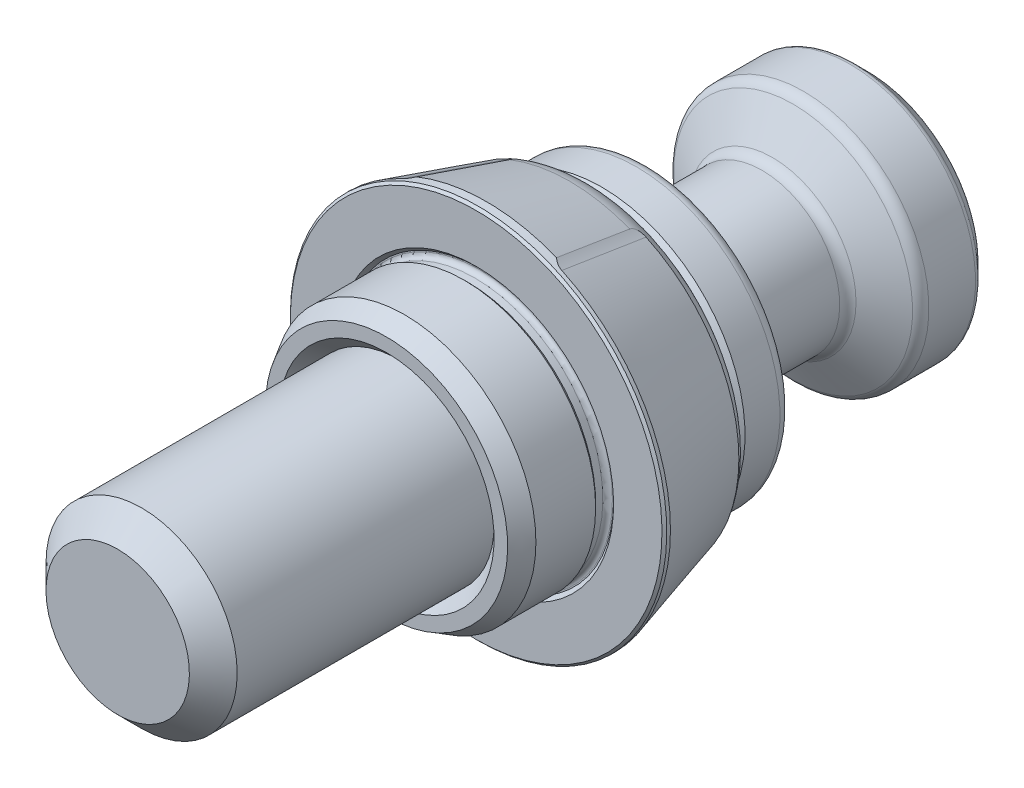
ISO-10303-21;
HEADER;
FILE_DESCRIPTION(('STEP AP214'),'2;1');
FILE_NAME('part.step','',(''),(''),'','','');
FILE_SCHEMA(('AUTOMOTIVE_DESIGN { 1 0 10303 214 1 1 1 1 }'));
ENDSEC;
DATA;
#1=APPLICATION_CONTEXT('core data for automotive mechanical design processes');
#2=APPLICATION_PROTOCOL_DEFINITION('international standard','automotive_design',2000,#1);
#3=PRODUCT_CONTEXT('',#1,'mechanical');
#4=PRODUCT('Part','Part','',(#3));
#5=PRODUCT_RELATED_PRODUCT_CATEGORY('part','',(#4));
#6=PRODUCT_DEFINITION_FORMATION('','',#4);
#7=PRODUCT_DEFINITION_CONTEXT('part definition',#1,'design');
#8=PRODUCT_DEFINITION('design','',#6,#7);
#9=PRODUCT_DEFINITION_SHAPE('','',#8);
#10=(LENGTH_UNIT() NAMED_UNIT(*) SI_UNIT(.MILLI.,.METRE.));
#11=(NAMED_UNIT(*) PLANE_ANGLE_UNIT() SI_UNIT($,.RADIAN.));
#12=(NAMED_UNIT(*) SI_UNIT($,.STERADIAN.) SOLID_ANGLE_UNIT());
#13=UNCERTAINTY_MEASURE_WITH_UNIT(LENGTH_MEASURE(1.E-05),#10,'distance_accuracy_value','');
#14=(GEOMETRIC_REPRESENTATION_CONTEXT(3) GLOBAL_UNCERTAINTY_ASSIGNED_CONTEXT((#13)) GLOBAL_UNIT_ASSIGNED_CONTEXT((#10,
#11,#12)) REPRESENTATION_CONTEXT('',''));
#15=CARTESIAN_POINT('',(0.,0.,0.));
#16=DIRECTION('',(0.,0.,1.));
#17=DIRECTION('',(1.,0.,0.));
#18=AXIS2_PLACEMENT_3D('',#15,#16,#17);
#19=CARTESIAN_POINT('',(-8.,0.,-10.));
#20=DIRECTION('',(0.,0.,1.));
#21=DIRECTION('',(0.,1.,0.));
#22=AXIS2_PLACEMENT_3D('',#19,#20,#21);
#23=PLANE('',#22);
#24=CARTESIAN_POINT('',(0.,0.,-10.));
#25=DIRECTION('',(0.,0.,1.));
#26=DIRECTION('',(0.,1.,0.));
#27=AXIS2_PLACEMENT_3D('',#24,#25,#26);
#28=CIRCLE('',#27,11.5);
#29=CARTESIAN_POINT('',(0.,11.5,-10.));
#30=VERTEX_POINT('',#29);
#31=EDGE_CURVE('E860',#30,#30,#28,.T.);
#32=ORIENTED_EDGE('',*,*,#31,.T.);
#33=EDGE_LOOP('',(#32));
#34=FACE_BOUND('',#33,.T.);
#35=CARTESIAN_POINT('',(0.,0.,-10.));
#36=DIRECTION('',(0.,0.,-1.));
#37=DIRECTION('',(0.,1.,0.));
#38=AXIS2_PLACEMENT_3D('',#35,#36,#37);
#39=CIRCLE('',#38,10.8718839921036);
#40=CARTESIAN_POINT('',(0.,10.8718839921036,-10.));
#41=VERTEX_POINT('',#40);
#42=EDGE_CURVE('E153',#41,#41,#39,.T.);
#43=ORIENTED_EDGE('',*,*,#42,.T.);
#44=EDGE_LOOP('',(#43));
#45=FACE_BOUND('',#44,.T.);
#46=ADVANCED_FACE('F14',(#34,#45),#23,.T.);
#47=CARTESIAN_POINT('',(0.,0.,-10.5));
#48=DIRECTION('',(0.,0.,-1.));
#49=DIRECTION('',(0.,-1.,0.));
#50=AXIS2_PLACEMENT_3D('',#47,#48,#49);
#51=CONICAL_SURFACE('',#50,12.,0.785398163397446);
#52=ORIENTED_EDGE('',*,*,#31,.F.);
#53=EDGE_LOOP('',(#52));
#54=FACE_BOUND('',#53,.T.);
#55=CARTESIAN_POINT('',(0.,0.,-10.5));
#56=DIRECTION('',(0.,0.,1.));
#57=DIRECTION('',(0.,1.,0.));
#58=AXIS2_PLACEMENT_3D('',#55,#56,#57);
#59=CIRCLE('',#58,12.);
#60=CARTESIAN_POINT('',(0.,12.,-10.5));
#61=VERTEX_POINT('',#60);
#62=EDGE_CURVE('E857',#61,#61,#59,.F.);
#63=ORIENTED_EDGE('',*,*,#62,.F.);
#64=EDGE_LOOP('',(#63));
#65=FACE_BOUND('',#64,.T.);
#66=ADVANCED_FACE('F294',(#54,#65),#51,.T.);
#67=CARTESIAN_POINT('',(0.,0.,-10.));
#68=DIRECTION('',(0.,0.,-1.));
#69=DIRECTION('',(0.,-1.,0.));
#70=AXIS2_PLACEMENT_3D('',#67,#68,#69);
#71=CYLINDRICAL_SURFACE('',#70,12.);
#72=CARTESIAN_POINT('',(0.,0.,-13.4226497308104));
#73=DIRECTION('',(0.,0.,-1.));
#74=DIRECTION('',(0.,-1.,0.));
#75=AXIS2_PLACEMENT_3D('',#72,#73,#74);
#76=CIRCLE('',#75,12.);
#77=CARTESIAN_POINT('',(0.,-12.,-13.4226497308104));
#78=VERTEX_POINT('',#77);
#79=EDGE_CURVE('E335',#78,#78,#76,.F.);
#80=ORIENTED_EDGE('',*,*,#79,.T.);
#81=EDGE_LOOP('',(#80));
#82=FACE_BOUND('',#81,.T.);
#83=ORIENTED_EDGE('',*,*,#62,.T.);
#84=EDGE_LOOP('',(#83));
#85=FACE_BOUND('',#84,.T.);
#86=ADVANCED_FACE('F264',(#82,#85),#71,.T.);
#87=CARTESIAN_POINT('',(0.,0.,-13.4226497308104));
#88=DIRECTION('',(0.,0.,-1.));
#89=DIRECTION('',(0.,-1.,0.));
#90=AXIS2_PLACEMENT_3D('',#87,#88,#89);
#91=TOROIDAL_SURFACE('',#90,11.,1.);
#92=CARTESIAN_POINT('',(0.,0.,-14.2886751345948));
#93=DIRECTION('',(0.,0.,-1.));
#94=DIRECTION('',(0.,-1.,0.));
#95=AXIS2_PLACEMENT_3D('',#92,#93,#94);
#96=CIRCLE('',#95,11.5);
#97=CARTESIAN_POINT('',(0.,-11.5,-14.2886751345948));
#98=VERTEX_POINT('',#97);
#99=EDGE_CURVE('E343',#98,#98,#96,.T.);
#100=ORIENTED_EDGE('',*,*,#99,.F.);
#101=EDGE_LOOP('',(#100));
#102=FACE_BOUND('',#101,.T.);
#103=ORIENTED_EDGE('',*,*,#79,.F.);
#104=EDGE_LOOP('',(#103));
#105=FACE_BOUND('',#104,.T.);
#106=ADVANCED_FACE('F254',(#102,#105),#91,.T.);
#107=CARTESIAN_POINT('',(0.,0.,-14.));
#108=DIRECTION('',(0.,0.,1.));
#109=DIRECTION('',(0.,1.,0.));
#110=AXIS2_PLACEMENT_3D('',#107,#108,#109);
#111=CONICAL_SURFACE('',#110,12.,1.0471975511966);
#112=ORIENTED_EDGE('',*,*,#99,.T.);
#113=EDGE_LOOP('',(#112));
#114=FACE_BOUND('',#113,.T.);
#115=CARTESIAN_POINT('',(0.,0.,-16.8867513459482));
#116=DIRECTION('',(0.,0.,1.));
#117=DIRECTION('',(0.,1.,0.));
#118=AXIS2_PLACEMENT_3D('',#115,#116,#117);
#119=CIRCLE('',#118,7.);
#120=CARTESIAN_POINT('',(0.,7.,-16.8867513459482));
#121=VERTEX_POINT('',#120);
#122=EDGE_CURVE('E888',#121,#121,#119,.T.);
#123=ORIENTED_EDGE('',*,*,#122,.T.);
#124=EDGE_LOOP('',(#123));
#125=FACE_BOUND('',#124,.T.);
#126=ADVANCED_FACE('F263',(#114,#125),#111,.T.);
#127=CARTESIAN_POINT('',(0.,0.,-17.7527767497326));
#128=DIRECTION('',(0.,0.,1.));
#129=DIRECTION('',(0.,1.,0.));
#130=AXIS2_PLACEMENT_3D('',#127,#128,#129);
#131=TOROIDAL_SURFACE('',#130,7.5,1.);
#132=CARTESIAN_POINT('',(0.,0.,-17.7527767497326));
#133=DIRECTION('',(0.,0.,1.));
#134=DIRECTION('',(0.,1.,0.));
#135=AXIS2_PLACEMENT_3D('',#132,#133,#134);
#136=CIRCLE('',#135,6.5);
#137=CARTESIAN_POINT('',(0.,6.5,-17.7527767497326));
#138=VERTEX_POINT('',#137);
#139=EDGE_CURVE('E879',#138,#138,#136,.F.);
#140=ORIENTED_EDGE('',*,*,#139,.F.);
#141=EDGE_LOOP('',(#140));
#142=FACE_BOUND('',#141,.T.);
#143=ORIENTED_EDGE('',*,*,#122,.F.);
#144=EDGE_LOOP('',(#143));
#145=FACE_BOUND('',#144,.T.);
#146=ADVANCED_FACE('F311',(#142,#145),#131,.F.);
#147=CARTESIAN_POINT('',(0.,0.,-10.));
#148=DIRECTION('',(0.,0.,1.));
#149=DIRECTION('',(0.,1.,0.));
#150=AXIS2_PLACEMENT_3D('',#147,#148,#149);
#151=CYLINDRICAL_SURFACE('',#150,6.5);
#152=CARTESIAN_POINT('',(0.,0.,-23.9226497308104));
#153=DIRECTION('',(0.,0.,1.));
#154=DIRECTION('',(0.,1.,0.));
#155=AXIS2_PLACEMENT_3D('',#152,#153,#154);
#156=CIRCLE('',#155,6.5);
#157=CARTESIAN_POINT('',(0.,6.5,-23.9226497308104));
#158=VERTEX_POINT('',#157);
#159=EDGE_CURVE('E882',#158,#158,#156,.T.);
#160=ORIENTED_EDGE('',*,*,#159,.T.);
#161=EDGE_LOOP('',(#160));
#162=FACE_BOUND('',#161,.T.);
#163=ORIENTED_EDGE('',*,*,#139,.T.);
#164=EDGE_LOOP('',(#163));
#165=FACE_BOUND('',#164,.T.);
#166=ADVANCED_FACE('F286',(#162,#165),#151,.T.);
#167=CARTESIAN_POINT('',(0.,0.,-23.9226497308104));
#168=DIRECTION('',(0.,0.,1.));
#169=DIRECTION('',(0.,1.,0.));
#170=AXIS2_PLACEMENT_3D('',#167,#168,#169);
#171=TOROIDAL_SURFACE('',#170,7.5,1.);
#172=CARTESIAN_POINT('',(0.,0.,-24.7886751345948));
#173=DIRECTION('',(0.,0.,-1.));
#174=DIRECTION('',(0.,-1.,0.));
#175=AXIS2_PLACEMENT_3D('',#172,#173,#174);
#176=CIRCLE('',#175,7.);
#177=CARTESIAN_POINT('',(0.,-7.,-24.7886751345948));
#178=VERTEX_POINT('',#177);
#179=EDGE_CURVE('E885',#178,#178,#176,.T.);
#180=ORIENTED_EDGE('',*,*,#179,.F.);
#181=EDGE_LOOP('',(#180));
#182=FACE_BOUND('',#181,.T.);
#183=ORIENTED_EDGE('',*,*,#159,.F.);
#184=EDGE_LOOP('',(#183));
#185=FACE_BOUND('',#184,.T.);
#186=ADVANCED_FACE('F306',(#182,#185),#171,.F.);
#187=CARTESIAN_POINT('',(0.,0.,-24.5));
#188=DIRECTION('',(0.,0.,-1.));
#189=DIRECTION('',(0.,-1.,0.));
#190=AXIS2_PLACEMENT_3D('',#187,#188,#189);
#191=CONICAL_SURFACE('',#190,6.5,1.0471975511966);
#192=CARTESIAN_POINT('',(0.,0.,-26.5207259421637));
#193=DIRECTION('',(0.,0.,1.));
#194=DIRECTION('',(0.,1.,0.));
#195=AXIS2_PLACEMENT_3D('',#192,#193,#194);
#196=CIRCLE('',#195,10.);
#197=CARTESIAN_POINT('',(0.,10.,-26.5207259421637));
#198=VERTEX_POINT('',#197);
#199=EDGE_CURVE('E345',#198,#198,#196,.T.);
#200=ORIENTED_EDGE('',*,*,#199,.T.);
#201=EDGE_LOOP('',(#200));
#202=FACE_BOUND('',#201,.T.);
#203=ORIENTED_EDGE('',*,*,#179,.T.);
#204=EDGE_LOOP('',(#203));
#205=FACE_BOUND('',#204,.T.);
#206=ADVANCED_FACE('F309',(#202,#205),#191,.T.);
#207=CARTESIAN_POINT('',(0.,0.,-27.3867513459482));
#208=DIRECTION('',(0.,0.,-1.));
#209=DIRECTION('',(0.,-1.,0.));
#210=AXIS2_PLACEMENT_3D('',#207,#208,#209);
#211=TOROIDAL_SURFACE('',#210,9.5,1.);
#212=CARTESIAN_POINT('',(0.,0.,-27.3867513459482));
#213=DIRECTION('',(0.,0.,-1.));
#214=DIRECTION('',(0.,-1.,0.));
#215=AXIS2_PLACEMENT_3D('',#212,#213,#214);
#216=CIRCLE('',#215,10.5);
#217=CARTESIAN_POINT('',(0.,-10.5,-27.3867513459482));
#218=VERTEX_POINT('',#217);
#219=EDGE_CURVE('E18',#218,#218,#216,.T.);
#220=ORIENTED_EDGE('',*,*,#219,.F.);
#221=EDGE_LOOP('',(#220));
#222=FACE_BOUND('',#221,.T.);
#223=ORIENTED_EDGE('',*,*,#199,.F.);
#224=EDGE_LOOP('',(#223));
#225=FACE_BOUND('',#224,.T.);
#226=ADVANCED_FACE('F16',(#222,#225),#211,.T.);
#227=CARTESIAN_POINT('',(0.,0.,-10.));
#228=DIRECTION('',(0.,0.,1.));
#229=DIRECTION('',(0.,1.,0.));
#230=AXIS2_PLACEMENT_3D('',#227,#228,#229);
#231=CYLINDRICAL_SURFACE('',#230,10.5);
#232=ORIENTED_EDGE('',*,*,#219,.T.);
#233=EDGE_LOOP('',(#232));
#234=FACE_BOUND('',#233,.T.);
#235=CARTESIAN_POINT('',(0.,0.,-31.2928932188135));
#236=DIRECTION('',(0.,0.,-1.));
#237=DIRECTION('',(0.,-1.,0.));
#238=AXIS2_PLACEMENT_3D('',#235,#236,#237);
#239=CIRCLE('',#238,10.5);
#240=CARTESIAN_POINT('',(0.,-10.5,-31.2928932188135));
#241=VERTEX_POINT('',#240);
#242=EDGE_CURVE('E891',#241,#241,#239,.F.);
#243=ORIENTED_EDGE('',*,*,#242,.T.);
#244=EDGE_LOOP('',(#243));
#245=FACE_BOUND('',#244,.T.);
#246=ADVANCED_FACE('F291',(#234,#245),#231,.T.);
#247=CARTESIAN_POINT('',(0.,0.,-31.2928932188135));
#248=DIRECTION('',(0.,0.,-1.));
#249=DIRECTION('',(0.,-1.,0.));
#250=AXIS2_PLACEMENT_3D('',#247,#248,#249);
#251=TOROIDAL_SURFACE('',#250,10.,0.5);
#252=CARTESIAN_POINT('',(0.,0.,-31.6464466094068));
#253=DIRECTION('',(0.,0.,-1.));
#254=DIRECTION('',(0.,-1.,0.));
#255=AXIS2_PLACEMENT_3D('',#252,#253,#254);
#256=CIRCLE('',#255,10.3535533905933);
#257=CARTESIAN_POINT('',(0.,-10.3535533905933,-31.6464466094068));
#258=VERTEX_POINT('',#257);
#259=EDGE_CURVE('E894',#258,#258,#256,.T.);
#260=ORIENTED_EDGE('',*,*,#259,.F.);
#261=EDGE_LOOP('',(#260));
#262=FACE_BOUND('',#261,.T.);
#263=ORIENTED_EDGE('',*,*,#242,.F.);
#264=EDGE_LOOP('',(#263));
#265=FACE_BOUND('',#264,.T.);
#266=ADVANCED_FACE('F315',(#262,#265),#251,.T.);
#267=CARTESIAN_POINT('',(0.,0.,-31.5));
#268=DIRECTION('',(0.,0.,1.));
#269=DIRECTION('',(0.,1.,0.));
#270=AXIS2_PLACEMENT_3D('',#267,#268,#269);
#271=CONICAL_SURFACE('',#270,10.5,0.785398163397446);
#272=CARTESIAN_POINT('',(0.,0.,-32.7071067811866));
#273=DIRECTION('',(0.,0.,-1.));
#274=DIRECTION('',(0.,-1.,0.));
#275=AXIS2_PLACEMENT_3D('',#272,#273,#274);
#276=CIRCLE('',#275,9.29289321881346);
#277=CARTESIAN_POINT('',(0.,-9.29289321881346,-32.7071067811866));
#278=VERTEX_POINT('',#277);
#279=EDGE_CURVE('E332',#278,#278,#276,.F.);
#280=ORIENTED_EDGE('',*,*,#279,.T.);
#281=EDGE_LOOP('',(#280));
#282=FACE_BOUND('',#281,.T.);
#283=ORIENTED_EDGE('',*,*,#259,.T.);
#284=EDGE_LOOP('',(#283));
#285=FACE_BOUND('',#284,.T.);
#286=ADVANCED_FACE('F211',(#282,#285),#271,.T.);
#287=CARTESIAN_POINT('',(0.,0.,-32.));
#288=DIRECTION('',(0.,0.,-1.));
#289=DIRECTION('',(0.,-1.,0.));
#290=AXIS2_PLACEMENT_3D('',#287,#288,#289);
#291=TOROIDAL_SURFACE('',#290,8.58578643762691,1.);
#292=CARTESIAN_POINT('',(0.,0.,-33.));
#293=DIRECTION('',(0.,0.,-1.));
#294=DIRECTION('',(0.,-1.,0.));
#295=AXIS2_PLACEMENT_3D('',#292,#293,#294);
#296=CIRCLE('',#295,8.58578643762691);
#297=CARTESIAN_POINT('',(0.,-8.58578643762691,-33.));
#298=VERTEX_POINT('',#297);
#299=EDGE_CURVE('E329',#298,#298,#296,.T.);
#300=ORIENTED_EDGE('',*,*,#299,.F.);
#301=EDGE_LOOP('',(#300));
#302=FACE_BOUND('',#301,.T.);
#303=ORIENTED_EDGE('',*,*,#279,.F.);
#304=EDGE_LOOP('',(#303));
#305=FACE_BOUND('',#304,.T.);
#306=ADVANCED_FACE('F208',(#302,#305),#291,.T.);
#307=CARTESIAN_POINT('',(-12.,0.,-33.));
#308=DIRECTION('',(0.,0.,-1.));
#309=DIRECTION('',(0.,-1.,0.));
#310=AXIS2_PLACEMENT_3D('',#307,#308,#309);
#311=PLANE('',#310);
#312=ORIENTED_EDGE('',*,*,#299,.T.);
#313=EDGE_LOOP('',(#312));
#314=FACE_BOUND('',#313,.T.);
#315=CARTESIAN_POINT('',(0.,0.,-33.));
#316=DIRECTION('',(0.,0.,1.));
#317=DIRECTION('',(0.,1.,0.));
#318=AXIS2_PLACEMENT_3D('',#315,#316,#317);
#319=CIRCLE('',#318,3.75);
#320=CARTESIAN_POINT('',(0.,3.75,-33.));
#321=VERTEX_POINT('',#320);
#322=EDGE_CURVE('E178',#321,#321,#319,.T.);
#323=ORIENTED_EDGE('',*,*,#322,.T.);
#324=EDGE_LOOP('',(#323));
#325=FACE_BOUND('',#324,.T.);
#326=ADVANCED_FACE('F206',(#314,#325),#311,.T.);
#327=CARTESIAN_POINT('',(0.,0.,-33.));
#328=DIRECTION('',(0.,0.,-1.));
#329=DIRECTION('',(0.,-1.,0.));
#330=AXIS2_PLACEMENT_3D('',#327,#328,#329);
#331=CONICAL_SURFACE('',#330,3.75,1.0471975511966);
#332=ORIENTED_EDGE('',*,*,#322,.F.);
#333=EDGE_LOOP('',(#332));
#334=FACE_BOUND('',#333,.T.);
#335=CARTESIAN_POINT('',(-1.73193533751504,3.0002,-32.8350031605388));
#336=CARTESIAN_POINT('',(-1.80805042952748,2.86836479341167,-32.7910410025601));
#337=CARTESIAN_POINT('',(-1.88482254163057,2.73539159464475,-32.7510588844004));
#338=CARTESIAN_POINT('',(-2.03969618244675,2.46714257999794,-32.6812693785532));
#339=CARTESIAN_POINT('',(-2.11780046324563,2.33186199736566,-32.6514866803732));
#340=CARTESIAN_POINT('',(-2.27304105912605,2.06297739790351,-32.605125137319));
#341=CARTESIAN_POINT('',(-2.35015348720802,1.92941475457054,-32.5882377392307));
#342=CARTESIAN_POINT('',(-2.50474122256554,1.66166094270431,-32.5680769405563));
#343=CARTESIAN_POINT('',(-2.58221596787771,1.52747074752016,-32.5647868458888));
#344=CARTESIAN_POINT('',(-2.72698443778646,1.27672440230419,-32.5716278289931));
#345=CARTESIAN_POINT('',(-2.79429982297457,1.16013073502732,-32.5800792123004));
#346=CARTESIAN_POINT('',(-2.92849202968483,0.927703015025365,-32.6068662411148));
#347=CARTESIAN_POINT('',(-2.99536838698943,0.81186976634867,-32.6252110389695));
#348=CARTESIAN_POINT('',(-3.12983731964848,0.578962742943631,-32.6710720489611));
#349=CARTESIAN_POINT('',(-3.19741287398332,0.461918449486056,-32.6987826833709));
#350=CARTESIAN_POINT('',(-3.33155605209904,0.229575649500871,-32.7616750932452));
#351=CARTESIAN_POINT('',(-3.39812539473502,0.114274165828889,-32.7968420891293));
#352=CARTESIAN_POINT('',(-3.4642170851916,-0.000200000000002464,-32.8350031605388));
#353=B_SPLINE_CURVE_WITH_KNOTS('',3,(#335,#336,#337,#338,#339,#340,#341,#342,#343,#344,#345,
#346,#347,#348,#349,#350,#351,#352),.UNSPECIFIED.,.F.,.F.,(4,2,2,2,2,2,2,2,4),(0.,
0.475539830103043,0.952222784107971,1.41710776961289,1.88142182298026,2.28572436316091,
2.69040156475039,3.10405572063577,3.51689749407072),.UNSPECIFIED.);
#354=CARTESIAN_POINT('',(-1.73205080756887,3.,-32.8349364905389));
#355=VERTEX_POINT('',#354);
#356=CARTESIAN_POINT('',(-3.46410161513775,0.,-32.8349364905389));
#357=VERTEX_POINT('',#356);
#358=EDGE_CURVE('E79',#355,#357,#353,.T.);
#359=ORIENTED_EDGE('',*,*,#358,.T.);
#360=CARTESIAN_POINT('',(-3.4642170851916,0.000199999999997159,-32.8350031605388));
#361=CARTESIAN_POINT('',(-3.38810199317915,-0.131635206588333,-32.7910410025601));
#362=CARTESIAN_POINT('',(-3.31132988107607,-0.26460840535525,-32.7510588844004));
#363=CARTESIAN_POINT('',(-3.15645624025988,-0.532857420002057,-32.6812693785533));
#364=CARTESIAN_POINT('',(-3.078351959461,-0.668138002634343,-32.6514866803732));
#365=CARTESIAN_POINT('',(-2.92311136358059,-0.937022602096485,-32.605125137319));
#366=CARTESIAN_POINT('',(-2.84599893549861,-1.07058524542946,-32.5882377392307));
#367=CARTESIAN_POINT('',(-2.6914112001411,-1.33833905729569,-32.5680769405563));
#368=CARTESIAN_POINT('',(-2.61393645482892,-1.47252925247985,-32.5647868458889));
#369=CARTESIAN_POINT('',(-2.46916798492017,-1.72327559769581,-32.5716278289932));
#370=CARTESIAN_POINT('',(-2.40185259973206,-1.83986926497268,-32.5800792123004));
#371=CARTESIAN_POINT('',(-2.2676603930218,-2.07229698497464,-32.6068662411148));
#372=CARTESIAN_POINT('',(-2.2007840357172,-2.18813023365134,-32.6252110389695));
#373=CARTESIAN_POINT('',(-2.06631510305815,-2.42103725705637,-32.6710720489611));
#374=CARTESIAN_POINT('',(-1.99873954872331,-2.53808155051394,-32.6987826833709));
#375=CARTESIAN_POINT('',(-1.86459637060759,-2.77042435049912,-32.7616750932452));
#376=CARTESIAN_POINT('',(-1.79802702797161,-2.88572583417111,-32.7968420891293));
#377=CARTESIAN_POINT('',(-1.73193533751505,-3.0002,-32.8350031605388));
#378=B_SPLINE_CURVE_WITH_KNOTS('',3,(#360,#361,#362,#363,#364,#365,#366,#367,#368,#369,#370,
#371,#372,#373,#374,#375,#376,#377),.UNSPECIFIED.,.F.,.F.,(4,2,2,2,2,2,2,2,4),(0.,
0.475539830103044,0.952222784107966,1.41710776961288,1.88142182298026,2.28572436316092,
2.69040156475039,3.10405572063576,3.5168974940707),.UNSPECIFIED.);
#379=CARTESIAN_POINT('',(-1.73205080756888,-3.,-32.8349364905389));
#380=VERTEX_POINT('',#379);
#381=EDGE_CURVE('E181',#357,#380,#378,.T.);
#382=ORIENTED_EDGE('',*,*,#381,.T.);
#383=CARTESIAN_POINT('',(4.57816394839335,-3.,-33.9950833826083));
#384=CARTESIAN_POINT('',(4.44770534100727,-3.,-33.9321019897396));
#385=CARTESIAN_POINT('',(4.3169390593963,-3.,-33.8697465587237));
#386=CARTESIAN_POINT('',(4.05462715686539,-3.,-33.7466413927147));
#387=CARTESIAN_POINT('',(3.92308140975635,-3.,-33.6858919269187));
#388=CARTESIAN_POINT('',(3.65833272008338,-3.,-33.5660308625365));
#389=CARTESIAN_POINT('',(3.52512459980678,-3.,-33.5069306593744));
#390=CARTESIAN_POINT('',(3.2576220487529,-3.,-33.3912515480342));
#391=CARTESIAN_POINT('',(3.12332767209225,-3.,-33.3346725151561));
#392=CARTESIAN_POINT('',(2.84947160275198,-3.,-33.2230876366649));
#393=CARTESIAN_POINT('',(2.70987100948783,-3.,-33.168176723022));
#394=CARTESIAN_POINT('',(2.42900957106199,-3.,-33.0626937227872));
#395=CARTESIAN_POINT('',(2.28774853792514,-3.,-33.0121221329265));
#396=CARTESIAN_POINT('',(2.00363062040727,-3.,-32.9166996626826));
#397=CARTESIAN_POINT('',(1.86077789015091,-3.,-32.871836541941));
#398=CARTESIAN_POINT('',(1.57302582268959,-3.,-32.789318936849));
#399=CARTESIAN_POINT('',(1.4281271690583,-3.,-32.7516621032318));
#400=CARTESIAN_POINT('',(1.13695389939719,-3.,-32.6855990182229));
#401=CARTESIAN_POINT('',(0.990689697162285,-3.,-32.657147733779));
#402=CARTESIAN_POINT('',(0.696423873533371,-3.,-32.6111671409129));
#403=CARTESIAN_POINT('',(0.548422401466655,-3.,-32.5936369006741));
#404=CARTESIAN_POINT('',(0.253322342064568,-3.,-32.5711271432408));
#405=CARTESIAN_POINT('',(0.106235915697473,-3.,-32.5659920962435));
#406=CARTESIAN_POINT('',(-0.187849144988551,-3.,-32.568302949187));
#407=CARTESIAN_POINT('',(-0.334847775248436,-3.,-32.5757493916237));
#408=CARTESIAN_POINT('',(-0.586621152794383,-3.,-32.5987632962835));
#409=CARTESIAN_POINT('',(-0.691671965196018,-3.,-32.6114663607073));
#410=CARTESIAN_POINT('',(-0.900950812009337,-3.,-32.6424661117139));
#411=CARTESIAN_POINT('',(-1.00517872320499,-3.,-32.6607636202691));
#412=CARTESIAN_POINT('',(-1.316515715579,-3.,-32.7230802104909));
#413=CARTESIAN_POINT('',(-1.52215497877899,-3.,-32.7745106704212));
#414=CARTESIAN_POINT('',(-1.82965945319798,-3.,-32.8630327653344));
#415=CARTESIAN_POINT('',(-1.93313257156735,-3.,-32.8948509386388));
#416=CARTESIAN_POINT('',(-2.13907223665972,-3.,-32.9616217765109));
#417=CARTESIAN_POINT('',(-2.24153877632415,-3.,-32.9965744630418));
#418=CARTESIAN_POINT('',(-2.4455023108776,-3.,-33.0690674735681));
#419=CARTESIAN_POINT('',(-2.54699964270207,-3.,-33.1066068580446));
#420=CARTESIAN_POINT('',(-2.74916366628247,-3.,-33.1838485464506));
#421=CARTESIAN_POINT('',(-2.84983037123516,-3.,-33.2235508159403));
#422=CARTESIAN_POINT('',(-3.10285866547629,-3.,-33.325976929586));
#423=CARTESIAN_POINT('',(-3.25473921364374,-3.,-33.3898874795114));
#424=CARTESIAN_POINT('',(-3.55712311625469,-3.,-33.5208972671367));
#425=CARTESIAN_POINT('',(-3.70762636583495,-3.,-33.587996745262));
#426=CARTESIAN_POINT('',(-4.00754037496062,-3.,-33.7246828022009));
#427=CARTESIAN_POINT('',(-4.15695085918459,-3.,-33.7942699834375));
#428=CARTESIAN_POINT('',(-4.45485069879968,-3.,-33.9353919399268));
#429=CARTESIAN_POINT('',(-4.60334003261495,-3.,-34.0069267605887));
#430=CARTESIAN_POINT('',(-5.04803783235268,-3.,-34.224009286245));
#431=CARTESIAN_POINT('',(-5.34311674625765,-3.,-34.3718687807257));
#432=CARTESIAN_POINT('',(-5.93116502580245,-3.,-34.6715928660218));
#433=CARTESIAN_POINT('',(-6.22413469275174,-3.,-34.823456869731));
#434=CARTESIAN_POINT('',(-6.78142028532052,-3.,-35.1157233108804));
#435=CARTESIAN_POINT('',(-7.0458664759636,-3.,-35.2558777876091));
#436=CARTESIAN_POINT('',(-7.57386151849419,-3.,-35.5378914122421));
#437=CARTESIAN_POINT('',(-7.83741033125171,-3.,-35.67975063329));
#438=CARTESIAN_POINT('',(-8.36311374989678,-3.,-35.9643722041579));
#439=CARTESIAN_POINT('',(-8.62527019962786,-3.,-36.1071311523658));
#440=CARTESIAN_POINT('',(-9.14901852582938,-3.,-36.3936442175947));
#441=CARTESIAN_POINT('',(-9.4106104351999,-3.,-36.5373982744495));
#442=CARTESIAN_POINT('',(-9.67199904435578,-3.,-36.6815185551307));
#443=B_SPLINE_CURVE_WITH_KNOTS('',3,(#383,#384,#385,#386,#387,#388,#389,#390,#391,#392,#393,
#394,#395,#396,#397,#398,#399,#400,#401,#402,#403,#404,#405,#406,#407,#408,#409,#410,#411,#412,
#413,#414,#415,#416,#417,#418,#419,#420,#421,#422,#423,#424,#425,#426,#427,#428,#429,#430,#431,
#432,#433,#434,#435,#436,#437,#438,#439,#440,#441,#442),.UNSPECIFIED.,.F.,.F.,(4,2,2,2,2,2,2,2,
2,2,2,2,2,2,2,2,2,2,2,2,2,2,2,2,2,2,2,2,2,4),(0.,0.434603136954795,0.869278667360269,
1.3064478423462,1.74359537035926,2.19357500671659,2.64360608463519,3.09265531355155,
3.54155790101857,3.98823005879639,4.43486409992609,4.87586414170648,5.31688319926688,
5.63417619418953,5.9515158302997,6.58656462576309,6.91130347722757,7.23604460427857,
7.56066839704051,7.88528702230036,8.37957333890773,8.87389698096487,9.3683411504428,
9.86279685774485,10.8528958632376,11.842850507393,12.7407149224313,13.6386179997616,
14.5341350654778,15.4295984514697),.UNSPECIFIED.);
#444=CARTESIAN_POINT('',(1.73205080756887,-3.,-32.8349364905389));
#445=VERTEX_POINT('',#444);
#446=EDGE_CURVE('E189',#380,#445,#443,.F.);
#447=ORIENTED_EDGE('',*,*,#446,.T.);
#448=CARTESIAN_POINT('',(1.73193533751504,-3.0002,-32.8350031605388));
#449=CARTESIAN_POINT('',(1.80805042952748,-2.86836479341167,-32.7910410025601));
#450=CARTESIAN_POINT('',(1.88482254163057,-2.73539159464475,-32.7510588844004));
#451=CARTESIAN_POINT('',(2.03969618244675,-2.46714257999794,-32.6812693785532));
#452=CARTESIAN_POINT('',(2.11780046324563,-2.33186199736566,-32.6514866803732));
#453=CARTESIAN_POINT('',(2.27304105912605,-2.06297739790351,-32.605125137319));
#454=CARTESIAN_POINT('',(2.35015348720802,-1.92941475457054,-32.5882377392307));
#455=CARTESIAN_POINT('',(2.50474122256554,-1.66166094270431,-32.5680769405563));
#456=CARTESIAN_POINT('',(2.58221596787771,-1.52747074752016,-32.5647868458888));
#457=CARTESIAN_POINT('',(2.72698443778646,-1.27672440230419,-32.5716278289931));
#458=CARTESIAN_POINT('',(2.79429982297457,-1.16013073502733,-32.5800792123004));
#459=CARTESIAN_POINT('',(2.92849202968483,-0.927703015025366,-32.6068662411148));
#460=CARTESIAN_POINT('',(2.99536838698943,-0.811869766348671,-32.6252110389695));
#461=CARTESIAN_POINT('',(3.12983731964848,-0.578962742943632,-32.6710720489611));
#462=CARTESIAN_POINT('',(3.19741287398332,-0.461918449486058,-32.6987826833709));
#463=CARTESIAN_POINT('',(3.33155605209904,-0.229575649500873,-32.7616750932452));
#464=CARTESIAN_POINT('',(3.39812539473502,-0.114274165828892,-32.7968420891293));
#465=CARTESIAN_POINT('',(3.4642170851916,0.000200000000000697,-32.8350031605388));
#466=B_SPLINE_CURVE_WITH_KNOTS('',3,(#448,#449,#450,#451,#452,#453,#454,#455,#456,#457,#458,
#459,#460,#461,#462,#463,#464,#465),.UNSPECIFIED.,.F.,.F.,(4,2,2,2,2,2,2,2,4),(0.,
0.475539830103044,0.952222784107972,1.41710776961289,1.88142182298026,2.28572436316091,
2.69040156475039,3.10405572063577,3.51689749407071),.UNSPECIFIED.);
#467=CARTESIAN_POINT('',(3.46410161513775,0.,-32.8349364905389));
#468=VERTEX_POINT('',#467);
#469=EDGE_CURVE('E219',#445,#468,#466,.T.);
#470=ORIENTED_EDGE('',*,*,#469,.T.);
#471=CARTESIAN_POINT('',(3.4642170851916,-0.000199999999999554,-32.8350031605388));
#472=CARTESIAN_POINT('',(3.38810199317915,0.13163520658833,-32.7910410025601));
#473=CARTESIAN_POINT('',(3.31132988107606,0.264608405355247,-32.7510588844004));
#474=CARTESIAN_POINT('',(3.15645624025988,0.532857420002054,-32.6812693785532));
#475=CARTESIAN_POINT('',(3.078351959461,0.668138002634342,-32.6514866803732));
#476=CARTESIAN_POINT('',(2.92311136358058,0.937022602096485,-32.605125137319));
#477=CARTESIAN_POINT('',(2.84599893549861,1.07058524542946,-32.5882377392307));
#478=CARTESIAN_POINT('',(2.69141120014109,1.33833905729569,-32.5680769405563));
#479=CARTESIAN_POINT('',(2.61393645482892,1.47252925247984,-32.5647868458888));
#480=CARTESIAN_POINT('',(2.46916798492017,1.72327559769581,-32.5716278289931));
#481=CARTESIAN_POINT('',(2.40185259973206,1.83986926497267,-32.5800792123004));
#482=CARTESIAN_POINT('',(2.2676603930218,2.07229698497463,-32.6068662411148));
#483=CARTESIAN_POINT('',(2.2007840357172,2.18813023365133,-32.6252110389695));
#484=CARTESIAN_POINT('',(2.06631510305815,2.42103725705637,-32.6710720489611));
#485=CARTESIAN_POINT('',(1.99873954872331,2.53808155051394,-32.6987826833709));
#486=CARTESIAN_POINT('',(1.86459637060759,2.77042435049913,-32.7616750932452));
#487=CARTESIAN_POINT('',(1.79802702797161,2.88572583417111,-32.7968420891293));
#488=CARTESIAN_POINT('',(1.73193533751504,3.0002,-32.8350031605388));
#489=B_SPLINE_CURVE_WITH_KNOTS('',3,(#471,#472,#473,#474,#475,#476,#477,#478,#479,#480,#481,
#482,#483,#484,#485,#486,#487,#488),.UNSPECIFIED.,.F.,.F.,(4,2,2,2,2,2,2,2,4),(0.,
0.475539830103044,0.952222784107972,1.41710776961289,1.88142182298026,2.28572436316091,
2.69040156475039,3.10405572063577,3.51689749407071),.UNSPECIFIED.);
#490=CARTESIAN_POINT('',(1.73205080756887,3.,-32.8349364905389));
#491=VERTEX_POINT('',#490);
#492=EDGE_CURVE('E226',#468,#491,#489,.T.);
#493=ORIENTED_EDGE('',*,*,#492,.T.);
#494=CARTESIAN_POINT('',(4.57816394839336,3.,-33.9950833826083));
#495=CARTESIAN_POINT('',(4.44770534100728,3.,-33.9321019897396));
#496=CARTESIAN_POINT('',(4.31693905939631,3.,-33.8697465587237));
#497=CARTESIAN_POINT('',(4.05462715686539,3.,-33.7466413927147));
#498=CARTESIAN_POINT('',(3.92308140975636,3.,-33.6858919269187));
#499=CARTESIAN_POINT('',(3.65833272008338,3.,-33.5660308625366));
#500=CARTESIAN_POINT('',(3.52512459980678,3.,-33.5069306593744));
#501=CARTESIAN_POINT('',(3.25762204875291,3.,-33.3912515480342));
#502=CARTESIAN_POINT('',(3.12332767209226,3.,-33.3346725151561));
#503=CARTESIAN_POINT('',(2.84947160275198,3.,-33.2230876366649));
#504=CARTESIAN_POINT('',(2.70987100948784,3.,-33.168176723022));
#505=CARTESIAN_POINT('',(2.42900957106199,3.,-33.0626937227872));
#506=CARTESIAN_POINT('',(2.28774853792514,3.,-33.0121221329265));
#507=CARTESIAN_POINT('',(2.00363062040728,3.,-32.9166996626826));
#508=CARTESIAN_POINT('',(1.86077789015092,3.,-32.871836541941));
#509=CARTESIAN_POINT('',(1.5730258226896,3.,-32.789318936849));
#510=CARTESIAN_POINT('',(1.4281271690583,3.,-32.7516621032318));
#511=CARTESIAN_POINT('',(1.13695389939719,3.,-32.6855990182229));
#512=CARTESIAN_POINT('',(0.990689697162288,3.,-32.657147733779));
#513=CARTESIAN_POINT('',(0.696423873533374,3.,-32.6111671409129));
#514=CARTESIAN_POINT('',(0.548422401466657,3.,-32.5936369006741));
#515=CARTESIAN_POINT('',(0.253322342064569,3.,-32.5711271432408));
#516=CARTESIAN_POINT('',(0.106235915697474,3.,-32.5659920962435));
#517=CARTESIAN_POINT('',(-0.18784914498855,3.,-32.568302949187));
#518=CARTESIAN_POINT('',(-0.334847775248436,3.,-32.5757493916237));
#519=CARTESIAN_POINT('',(-0.586621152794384,3.,-32.5987632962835));
#520=CARTESIAN_POINT('',(-0.691671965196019,3.,-32.6114663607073));
#521=CARTESIAN_POINT('',(-0.900950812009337,3.,-32.6424661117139));
#522=CARTESIAN_POINT('',(-1.00517872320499,3.,-32.6607636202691));
#523=CARTESIAN_POINT('',(-1.316515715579,3.,-32.7230802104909));
#524=CARTESIAN_POINT('',(-1.52215497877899,3.,-32.7745106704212));
#525=CARTESIAN_POINT('',(-1.82965945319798,3.,-32.8630327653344));
#526=CARTESIAN_POINT('',(-1.93313257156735,3.,-32.8948509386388));
#527=CARTESIAN_POINT('',(-2.13907223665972,3.,-32.9616217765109));
#528=CARTESIAN_POINT('',(-2.24153877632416,3.,-32.9965744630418));
#529=CARTESIAN_POINT('',(-2.44550231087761,3.,-33.0690674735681));
#530=CARTESIAN_POINT('',(-2.54699964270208,3.,-33.1066068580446));
#531=CARTESIAN_POINT('',(-2.74916366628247,3.,-33.1838485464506));
#532=CARTESIAN_POINT('',(-2.84983037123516,3.,-33.2235508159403));
#533=CARTESIAN_POINT('',(-3.1028586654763,3.,-33.325976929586));
#534=CARTESIAN_POINT('',(-3.25473921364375,3.,-33.3898874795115));
#535=CARTESIAN_POINT('',(-3.5571231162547,3.,-33.5208972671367));
#536=CARTESIAN_POINT('',(-3.70762636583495,3.,-33.587996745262));
#537=CARTESIAN_POINT('',(-4.00754037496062,3.,-33.7246828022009));
#538=CARTESIAN_POINT('',(-4.15695085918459,3.,-33.7942699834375));
#539=CARTESIAN_POINT('',(-4.45485069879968,3.,-33.9353919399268));
#540=CARTESIAN_POINT('',(-4.60334003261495,3.,-34.0069267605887));
#541=CARTESIAN_POINT('',(-5.04803783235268,3.,-34.224009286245));
#542=CARTESIAN_POINT('',(-5.34311674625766,3.,-34.3718687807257));
#543=CARTESIAN_POINT('',(-5.93116502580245,3.,-34.6715928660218));
#544=CARTESIAN_POINT('',(-6.22413469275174,3.,-34.823456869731));
#545=CARTESIAN_POINT('',(-6.78142028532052,3.,-35.1157233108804));
#546=CARTESIAN_POINT('',(-7.0458664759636,3.,-35.2558777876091));
#547=CARTESIAN_POINT('',(-7.57386151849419,3.,-35.5378914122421));
#548=CARTESIAN_POINT('',(-7.83741033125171,3.,-35.67975063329));
#549=CARTESIAN_POINT('',(-8.36311374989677,3.,-35.9643722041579));
#550=CARTESIAN_POINT('',(-8.62527019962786,3.,-36.1071311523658));
#551=CARTESIAN_POINT('',(-9.14901852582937,3.,-36.3936442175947));
#552=CARTESIAN_POINT('',(-9.4106104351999,3.,-36.5373982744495));
#553=CARTESIAN_POINT('',(-9.67199904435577,3.,-36.6815185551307));
#554=B_SPLINE_CURVE_WITH_KNOTS('',3,(#494,#495,#496,#497,#498,#499,#500,#501,#502,#503,#504,
#505,#506,#507,#508,#509,#510,#511,#512,#513,#514,#515,#516,#517,#518,#519,#520,#521,#522,#523,
#524,#525,#526,#527,#528,#529,#530,#531,#532,#533,#534,#535,#536,#537,#538,#539,#540,#541,#542,
#543,#544,#545,#546,#547,#548,#549,#550,#551,#552,#553),.UNSPECIFIED.,.F.,.F.,(4,2,2,2,2,2,2,2,
2,2,2,2,2,2,2,2,2,2,2,2,2,2,2,2,2,2,2,2,2,4),(0.,0.434603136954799,0.869278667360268,
1.3064478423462,1.74359537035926,2.19357500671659,2.64360608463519,3.09265531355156,
3.54155790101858,3.98823005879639,4.4348640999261,4.87586414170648,5.31688319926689,
5.63417619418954,5.95151583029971,6.58656462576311,6.91130347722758,7.23604460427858,
7.56066839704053,7.88528702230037,8.37957333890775,8.87389698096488,9.36834115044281,
9.86279685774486,10.8528958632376,11.842850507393,12.7407149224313,13.6386179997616,
14.5341350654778,15.4295984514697),.UNSPECIFIED.);
#555=EDGE_CURVE('E233',#491,#355,#554,.T.);
#556=ORIENTED_EDGE('',*,*,#555,.T.);
#557=EDGE_LOOP('',(#359,#382,#447,#470,#493,#556));
#558=FACE_BOUND('',#557,.T.);
#559=ADVANCED_FACE('F200',(#334,#558),#331,.F.);
#560=CARTESIAN_POINT('',(-3.46410161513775,0.,-28.5));
#561=DIRECTION('',(-0.866025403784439,0.5,0.));
#562=DIRECTION('',(-0.5,-0.866025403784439,0.));
#563=AXIS2_PLACEMENT_3D('',#560,#561,#562);
#564=PLANE('',#563);
#565=ORIENTED_EDGE('',*,*,#358,.F.);
#566=DIRECTION('',(0.,0.,-1.));
#567=VECTOR('',#566,1.);
#568=CARTESIAN_POINT('',(-1.73205080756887,3.,-28.5));
#569=LINE('',#568,#567);
#570=CARTESIAN_POINT('',(-1.73205080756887,3.,-28.5));
#571=VERTEX_POINT('',#570);
#572=EDGE_CURVE('E872',#571,#355,#569,.T.);
#573=ORIENTED_EDGE('',*,*,#572,.F.);
#574=DIRECTION('',(0.5,0.866025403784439,0.));
#575=VECTOR('',#574,1.);
#576=CARTESIAN_POINT('',(-3.46410161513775,0.,-28.5));
#577=LINE('',#576,#575);
#578=CARTESIAN_POINT('',(-3.46410161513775,0.,-28.5));
#579=VERTEX_POINT('',#578);
#580=EDGE_CURVE('E928',#579,#571,#577,.T.);
#581=ORIENTED_EDGE('',*,*,#580,.F.);
#582=DIRECTION('',(0.,0.,-1.));
#583=VECTOR('',#582,1.);
#584=CARTESIAN_POINT('',(-3.46410161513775,0.,-28.5));
#585=LINE('',#584,#583);
#586=EDGE_CURVE('E875',#579,#357,#585,.T.);
#587=ORIENTED_EDGE('',*,*,#586,.T.);
#588=EDGE_LOOP('',(#565,#573,#581,#587));
#589=FACE_BOUND('',#588,.T.);
#590=ADVANCED_FACE('F205',(#589),#564,.F.);
#591=CARTESIAN_POINT('',(-1.73205080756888,-3.,-28.5));
#592=DIRECTION('',(-0.866025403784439,-0.5,0.));
#593=DIRECTION('',(0.5,-0.866025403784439,0.));
#594=AXIS2_PLACEMENT_3D('',#591,#592,#593);
#595=PLANE('',#594);
#596=ORIENTED_EDGE('',*,*,#381,.F.);
#597=ORIENTED_EDGE('',*,*,#586,.F.);
#598=DIRECTION('',(-0.5,0.866025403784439,0.));
#599=VECTOR('',#598,1.);
#600=CARTESIAN_POINT('',(-1.73205080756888,-3.,-28.5));
#601=LINE('',#600,#599);
#602=CARTESIAN_POINT('',(-1.73205080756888,-3.,-28.5));
#603=VERTEX_POINT('',#602);
#604=EDGE_CURVE('E856',#603,#579,#601,.T.);
#605=ORIENTED_EDGE('',*,*,#604,.F.);
#606=DIRECTION('',(0.,0.,-1.));
#607=VECTOR('',#606,1.);
#608=CARTESIAN_POINT('',(-1.73205080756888,-3.,-28.5));
#609=LINE('',#608,#607);
#610=EDGE_CURVE('E849',#603,#380,#609,.T.);
#611=ORIENTED_EDGE('',*,*,#610,.T.);
#612=EDGE_LOOP('',(#596,#597,#605,#611));
#613=FACE_BOUND('',#612,.T.);
#614=ADVANCED_FACE('F196',(#613),#595,.F.);
#615=CARTESIAN_POINT('',(1.73205080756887,-3.,-28.5));
#616=DIRECTION('',(0.,-1.,0.));
#617=DIRECTION('',(1.,0.,0.));
#618=AXIS2_PLACEMENT_3D('',#615,#616,#617);
#619=PLANE('',#618);
#620=ORIENTED_EDGE('',*,*,#446,.F.);
#621=ORIENTED_EDGE('',*,*,#610,.F.);
#622=DIRECTION('',(-1.,0.,0.));
#623=VECTOR('',#622,1.);
#624=CARTESIAN_POINT('',(1.73205080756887,-3.,-28.5));
#625=LINE('',#624,#623);
#626=CARTESIAN_POINT('',(1.73205080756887,-3.,-28.5));
#627=VERTEX_POINT('',#626);
#628=EDGE_CURVE('E73',#627,#603,#625,.T.);
#629=ORIENTED_EDGE('',*,*,#628,.F.);
#630=DIRECTION('',(0.,0.,-1.));
#631=VECTOR('',#630,1.);
#632=CARTESIAN_POINT('',(1.73205080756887,-3.,-28.5));
#633=LINE('',#632,#631);
#634=EDGE_CURVE('E852',#627,#445,#633,.T.);
#635=ORIENTED_EDGE('',*,*,#634,.T.);
#636=EDGE_LOOP('',(#620,#621,#629,#635));
#637=FACE_BOUND('',#636,.T.);
#638=ADVANCED_FACE('F260',(#637),#619,.F.);
#639=CARTESIAN_POINT('',(3.46410161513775,0.,-28.5));
#640=DIRECTION('',(0.866025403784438,-0.5,0.));
#641=DIRECTION('',(0.5,0.866025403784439,0.));
#642=AXIS2_PLACEMENT_3D('',#639,#640,#641);
#643=PLANE('',#642);
#644=ORIENTED_EDGE('',*,*,#469,.F.);
#645=ORIENTED_EDGE('',*,*,#634,.F.);
#646=DIRECTION('',(-0.5,-0.866025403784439,0.));
#647=VECTOR('',#646,1.);
#648=CARTESIAN_POINT('',(3.46410161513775,0.,-28.5));
#649=LINE('',#648,#647);
#650=CARTESIAN_POINT('',(3.46410161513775,0.,-28.5));
#651=VERTEX_POINT('',#650);
#652=EDGE_CURVE('E921',#651,#627,#649,.T.);
#653=ORIENTED_EDGE('',*,*,#652,.F.);
#654=DIRECTION('',(0.,0.,-1.));
#655=VECTOR('',#654,1.);
#656=CARTESIAN_POINT('',(3.46410161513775,0.,-28.5));
#657=LINE('',#656,#655);
#658=EDGE_CURVE('E862',#651,#468,#657,.T.);
#659=ORIENTED_EDGE('',*,*,#658,.T.);
#660=EDGE_LOOP('',(#644,#645,#653,#659));
#661=FACE_BOUND('',#660,.T.);
#662=ADVANCED_FACE('F830',(#661),#643,.F.);
#663=CARTESIAN_POINT('',(1.73205080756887,3.,-28.5));
#664=DIRECTION('',(0.866025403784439,0.5,0.));
#665=DIRECTION('',(-0.5,0.866025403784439,0.));
#666=AXIS2_PLACEMENT_3D('',#663,#664,#665);
#667=PLANE('',#666);
#668=ORIENTED_EDGE('',*,*,#492,.F.);
#669=ORIENTED_EDGE('',*,*,#658,.F.);
#670=DIRECTION('',(0.5,-0.866025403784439,0.));
#671=VECTOR('',#670,1.);
#672=CARTESIAN_POINT('',(1.73205080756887,3.,-28.5));
#673=LINE('',#672,#671);
#674=CARTESIAN_POINT('',(1.73205080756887,3.,-28.5));
#675=VERTEX_POINT('',#674);
#676=EDGE_CURVE('E922',#675,#651,#673,.T.);
#677=ORIENTED_EDGE('',*,*,#676,.F.);
#678=DIRECTION('',(0.,0.,-1.));
#679=VECTOR('',#678,1.);
#680=CARTESIAN_POINT('',(1.73205080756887,3.,-28.5));
#681=LINE('',#680,#679);
#682=EDGE_CURVE('E869',#675,#491,#681,.T.);
#683=ORIENTED_EDGE('',*,*,#682,.T.);
#684=EDGE_LOOP('',(#668,#669,#677,#683));
#685=FACE_BOUND('',#684,.T.);
#686=ADVANCED_FACE('F248',(#685),#667,.F.);
#687=CARTESIAN_POINT('',(-1.73205080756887,3.,-28.5));
#688=DIRECTION('',(0.,1.,0.));
#689=DIRECTION('',(-1.,0.,0.));
#690=AXIS2_PLACEMENT_3D('',#687,#688,#689);
#691=PLANE('',#690);
#692=ORIENTED_EDGE('',*,*,#555,.F.);
#693=ORIENTED_EDGE('',*,*,#682,.F.);
#694=DIRECTION('',(1.,0.,0.));
#695=VECTOR('',#694,1.);
#696=CARTESIAN_POINT('',(-1.73205080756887,3.,-28.5));
#697=LINE('',#696,#695);
#698=EDGE_CURVE('E924',#571,#675,#697,.T.);
#699=ORIENTED_EDGE('',*,*,#698,.F.);
#700=ORIENTED_EDGE('',*,*,#572,.T.);
#701=EDGE_LOOP('',(#692,#693,#699,#700));
#702=FACE_BOUND('',#701,.T.);
#703=ADVANCED_FACE('F244',(#702),#691,.F.);
#704=CARTESIAN_POINT('',(-3.46410161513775,0.,-28.5));
#705=DIRECTION('',(0.,0.,-1.));
#706=DIRECTION('',(0.,-1.,0.));
#707=AXIS2_PLACEMENT_3D('',#704,#705,#706);
#708=PLANE('',#707);
#709=ORIENTED_EDGE('',*,*,#698,.T.);
#710=ORIENTED_EDGE('',*,*,#676,.T.);
#711=ORIENTED_EDGE('',*,*,#652,.T.);
#712=ORIENTED_EDGE('',*,*,#628,.T.);
#713=ORIENTED_EDGE('',*,*,#604,.T.);
#714=ORIENTED_EDGE('',*,*,#580,.T.);
#715=EDGE_LOOP('',(#709,#710,#711,#712,#713,#714));
#716=FACE_BOUND('',#715,.T.);
#717=ADVANCED_FACE('F247',(#716),#708,.T.);
#718=CARTESIAN_POINT('',(0.,0.,-10.));
#719=DIRECTION('',(0.,0.,-1.));
#720=DIRECTION('',(0.,-1.,0.));
#721=AXIS2_PLACEMENT_3D('',#718,#719,#720);
#722=CYLINDRICAL_SURFACE('',#721,8.);
#723=CARTESIAN_POINT('',(0.,0.,6.5));
#724=DIRECTION('',(0.,0.,1.));
#725=DIRECTION('',(0.,-1.,0.));
#726=AXIS2_PLACEMENT_3D('',#723,#724,#725);
#727=CIRCLE('',#726,8.);
#728=CARTESIAN_POINT('',(0.,-8.,6.5));
#729=VERTEX_POINT('',#728);
#730=EDGE_CURVE('E162',#729,#729,#727,.T.);
#731=ORIENTED_EDGE('',*,*,#730,.T.);
#732=EDGE_LOOP('',(#731));
#733=FACE_BOUND('',#732,.T.);
#734=CARTESIAN_POINT('',(0.,0.,28.));
#735=DIRECTION('',(0.,0.,1.));
#736=DIRECTION('',(0.,1.,0.));
#737=AXIS2_PLACEMENT_3D('',#734,#735,#736);
#738=CIRCLE('',#737,8.);
#739=CARTESIAN_POINT('',(0.,8.,28.));
#740=VERTEX_POINT('',#739);
#741=EDGE_CURVE('E337',#740,#740,#738,.F.);
#742=ORIENTED_EDGE('',*,*,#741,.T.);
#743=EDGE_LOOP('',(#742));
#744=FACE_BOUND('',#743,.T.);
#745=ADVANCED_FACE('F280',(#733,#744),#722,.T.);
#746=CARTESIAN_POINT('',(0.,0.,28.));
#747=DIRECTION('',(0.,0.,-1.));
#748=DIRECTION('',(0.,-1.,0.));
#749=AXIS2_PLACEMENT_3D('',#746,#747,#748);
#750=CONICAL_SURFACE('',#749,8.,0.78539816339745);
#751=CARTESIAN_POINT('',(0.,0.,30.));
#752=DIRECTION('',(0.,0.,1.));
#753=DIRECTION('',(0.,1.,0.));
#754=AXIS2_PLACEMENT_3D('',#751,#752,#753);
#755=CIRCLE('',#754,6.);
#756=CARTESIAN_POINT('',(0.,6.,30.));
#757=VERTEX_POINT('',#756);
#758=EDGE_CURVE('E333',#757,#757,#755,.T.);
#759=ORIENTED_EDGE('',*,*,#758,.F.);
#760=EDGE_LOOP('',(#759));
#761=FACE_BOUND('',#760,.T.);
#762=ORIENTED_EDGE('',*,*,#741,.F.);
#763=EDGE_LOOP('',(#762));
#764=FACE_BOUND('',#763,.T.);
#765=ADVANCED_FACE('F269',(#761,#764),#750,.T.);
#766=CARTESIAN_POINT('',(0.,0.,30.));
#767=DIRECTION('',(0.,0.,1.));
#768=DIRECTION('',(0.,1.,0.));
#769=AXIS2_PLACEMENT_3D('',#766,#767,#768);
#770=PLANE('',#769);
#771=ORIENTED_EDGE('',*,*,#758,.T.);
#772=EDGE_LOOP('',(#771));
#773=FACE_BOUND('',#772,.T.);
#774=ADVANCED_FACE('F266',(#773),#770,.T.);
#775=CARTESIAN_POINT('',(0.,0.,7.5));
#776=DIRECTION('',(0.,0.,1.));
#777=DIRECTION('',(0.,-1.,0.));
#778=AXIS2_PLACEMENT_3D('',#775,#776,#777);
#779=CONICAL_SURFACE('',#778,9.,0.785398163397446);
#780=ORIENTED_EDGE('',*,*,#730,.F.);
#781=EDGE_LOOP('',(#780));
#782=FACE_BOUND('',#781,.T.);
#783=CARTESIAN_POINT('',(0.,0.,7.5));
#784=DIRECTION('',(0.,0.,1.));
#785=DIRECTION('',(0.,-1.,0.));
#786=AXIS2_PLACEMENT_3D('',#783,#784,#785);
#787=CIRCLE('',#786,9.);
#788=CARTESIAN_POINT('',(0.,-9.,7.5));
#789=VERTEX_POINT('',#788);
#790=EDGE_CURVE('E159',#789,#789,#787,.F.);
#791=ORIENTED_EDGE('',*,*,#790,.F.);
#792=EDGE_LOOP('',(#791));
#793=FACE_BOUND('',#792,.T.);
#794=ADVANCED_FACE('F268',(#782,#793),#779,.F.);
#795=CARTESIAN_POINT('',(8.,0.,7.5));
#796=DIRECTION('',(0.,0.,1.));
#797=DIRECTION('',(0.,-1.,0.));
#798=AXIS2_PLACEMENT_3D('',#795,#796,#797);
#799=PLANE('',#798);
#800=ORIENTED_EDGE('',*,*,#790,.T.);
#801=EDGE_LOOP('',(#800));
#802=FACE_BOUND('',#801,.T.);
#803=CARTESIAN_POINT('',(0.,0.,7.5));
#804=DIRECTION('',(0.,0.,1.));
#805=DIRECTION('',(0.,-1.,0.));
#806=AXIS2_PLACEMENT_3D('',#803,#804,#805);
#807=CIRCLE('',#806,10.1339745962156);
#808=CARTESIAN_POINT('',(0.,-10.1339745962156,7.5));
#809=VERTEX_POINT('',#808);
#810=EDGE_CURVE('E151',#809,#809,#807,.T.);
#811=ORIENTED_EDGE('',*,*,#810,.T.);
#812=EDGE_LOOP('',(#811));
#813=FACE_BOUND('',#812,.T.);
#814=ADVANCED_FACE('F277',(#802,#813),#799,.T.);
#815=CARTESIAN_POINT('',(0.,0.,6.));
#816=DIRECTION('',(0.,0.,-1.));
#817=DIRECTION('',(0.,1.,0.));
#818=AXIS2_PLACEMENT_3D('',#815,#816,#817);
#819=CONICAL_SURFACE('',#818,11.,0.523598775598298);
#820=ORIENTED_EDGE('',*,*,#810,.F.);
#821=EDGE_LOOP('',(#820));
#822=FACE_BOUND('',#821,.T.);
#823=CARTESIAN_POINT('',(0.,0.,6.));
#824=DIRECTION('',(0.,0.,1.));
#825=DIRECTION('',(0.,-1.,0.));
#826=AXIS2_PLACEMENT_3D('',#823,#824,#825);
#827=CIRCLE('',#826,11.);
#828=CARTESIAN_POINT('',(0.,-11.,6.));
#829=VERTEX_POINT('',#828);
#830=EDGE_CURVE('E147',#829,#829,#827,.F.);
#831=ORIENTED_EDGE('',*,*,#830,.F.);
#832=EDGE_LOOP('',(#831));
#833=FACE_BOUND('',#832,.T.);
#834=ADVANCED_FACE('F566',(#822,#833),#819,.T.);
#835=CARTESIAN_POINT('',(0.,0.,0.));
#836=DIRECTION('',(0.,0.,-1.));
#837=DIRECTION('',(0.,1.,0.));
#838=AXIS2_PLACEMENT_3D('',#835,#836,#837);
#839=CYLINDRICAL_SURFACE('',#838,11.);
#840=CARTESIAN_POINT('',(0.,0.,1.));
#841=DIRECTION('',(0.,0.,-1.));
#842=DIRECTION('',(0.,1.,0.));
#843=AXIS2_PLACEMENT_3D('',#840,#841,#842);
#844=CIRCLE('',#843,11.);
#845=CARTESIAN_POINT('',(0.,11.,1.));
#846=VERTEX_POINT('',#845);
#847=EDGE_CURVE('E490',#846,#846,#844,.T.);
#848=ORIENTED_EDGE('',*,*,#847,.F.);
#849=EDGE_LOOP('',(#848));
#850=FACE_BOUND('',#849,.T.);
#851=ORIENTED_EDGE('',*,*,#830,.T.);
#852=EDGE_LOOP('',(#851));
#853=FACE_BOUND('',#852,.T.);
#854=ADVANCED_FACE('F557',(#850,#853),#839,.T.);
#855=CARTESIAN_POINT('',(0.,0.,1.));
#856=DIRECTION('',(0.,0.,1.));
#857=DIRECTION('',(0.,-1.,0.));
#858=AXIS2_PLACEMENT_3D('',#855,#856,#857);
#859=CONICAL_SURFACE('',#858,11.,0.78539816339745);
#860=CARTESIAN_POINT('',(0.,0.,0.7));
#861=DIRECTION('',(0.,0.,-1.));
#862=DIRECTION('',(0.,1.,0.));
#863=AXIS2_PLACEMENT_3D('',#860,#861,#862);
#864=CIRCLE('',#863,10.7);
#865=CARTESIAN_POINT('',(0.,10.7,0.7));
#866=VERTEX_POINT('',#865);
#867=EDGE_CURVE('E487',#866,#866,#864,.T.);
#868=ORIENTED_EDGE('',*,*,#867,.F.);
#869=EDGE_LOOP('',(#868));
#870=FACE_BOUND('',#869,.T.);
#871=ORIENTED_EDGE('',*,*,#847,.T.);
#872=EDGE_LOOP('',(#871));
#873=FACE_BOUND('',#872,.T.);
#874=ADVANCED_FACE('F548',(#870,#873),#859,.T.);
#875=CARTESIAN_POINT('',(0.,0.,0.));
#876=DIRECTION('',(0.,0.,-1.));
#877=DIRECTION('',(0.,1.,0.));
#878=AXIS2_PLACEMENT_3D('',#875,#876,#877);
#879=CYLINDRICAL_SURFACE('',#878,10.7);
#880=CARTESIAN_POINT('',(0.,0.,0.1));
#881=DIRECTION('',(0.,0.,-1.));
#882=DIRECTION('',(0.,1.,0.));
#883=AXIS2_PLACEMENT_3D('',#880,#881,#882);
#884=CIRCLE('',#883,10.7);
#885=CARTESIAN_POINT('',(0.,10.7,0.1));
#886=VERTEX_POINT('',#885);
#887=EDGE_CURVE('E174',#886,#886,#884,.F.);
#888=ORIENTED_EDGE('',*,*,#887,.T.);
#889=EDGE_LOOP('',(#888));
#890=FACE_BOUND('',#889,.T.);
#891=ORIENTED_EDGE('',*,*,#867,.T.);
#892=EDGE_LOOP('',(#891));
#893=FACE_BOUND('',#892,.T.);
#894=ADVANCED_FACE('F540',(#890,#893),#879,.T.);
#895=CARTESIAN_POINT('',(0.,0.,0.1));
#896=DIRECTION('',(0.,0.,-1.));
#897=DIRECTION('',(0.,1.,0.));
#898=AXIS2_PLACEMENT_3D('',#895,#896,#897);
#899=TOROIDAL_SURFACE('',#898,11.1,0.4);
#900=ORIENTED_EDGE('',*,*,#887,.F.);
#901=EDGE_LOOP('',(#900));
#902=FACE_BOUND('',#901,.T.);
#903=CARTESIAN_POINT('',(0.,0.,-0.3));
#904=DIRECTION('',(0.,0.,-1.));
#905=DIRECTION('',(0.,1.,0.));
#906=AXIS2_PLACEMENT_3D('',#903,#904,#905);
#907=CIRCLE('',#906,11.1);
#908=CARTESIAN_POINT('',(0.,11.1,-0.3));
#909=VERTEX_POINT('',#908);
#910=EDGE_CURVE('E171',#909,#909,#907,.T.);
#911=ORIENTED_EDGE('',*,*,#910,.F.);
#912=EDGE_LOOP('',(#911));
#913=FACE_BOUND('',#912,.T.);
#914=ADVANCED_FACE('F209',(#902,#913),#899,.F.);
#915=CARTESIAN_POINT('',(0.,0.,-7.));
#916=DIRECTION('',(0.,0.,-1.));
#917=DIRECTION('',(0.,1.,0.));
#918=AXIS2_PLACEMENT_3D('',#915,#916,#917);
#919=TOROIDAL_SURFACE('',#918,10.8718839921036,3.);
#920=ORIENTED_EDGE('',*,*,#42,.F.);
#921=EDGE_LOOP('',(#920));
#922=FACE_BOUND('',#921,.T.);
#923=CARTESIAN_POINT('',(0.,0.,-7.82691206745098));
#924=DIRECTION('',(0.,0.,-1.));
#925=DIRECTION('',(0.,1.,0.));
#926=AXIS2_PLACEMENT_3D('',#923,#924,#925);
#927=CIRCLE('',#926,13.7556690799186);
#928=CARTESIAN_POINT('',(-5.02412093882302,-12.805336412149,-7.82691206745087));
#929=VERTEX_POINT('',#928);
#930=CARTESIAN_POINT('',(5.02412093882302,-12.8053364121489,-7.82691206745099));
#931=VERTEX_POINT('',#930);
#932=EDGE_CURVE('E148',#929,#931,#927,.F.);
#933=ORIENTED_EDGE('',*,*,#932,.F.);
#934=CARTESIAN_POINT('',(-5.02414482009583,-12.8053886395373,-7.82671206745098));
#935=CARTESIAN_POINT('',(-5.01915697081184,-12.7946605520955,-7.86803060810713));
#936=CARTESIAN_POINT('',(-5.01756748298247,-12.781568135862,-7.90909915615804));
#937=CARTESIAN_POINT('',(-5.02102608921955,-12.751444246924,-7.98929282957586));
#938=CARTESIAN_POINT('',(-5.02604764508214,-12.7344287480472,-8.02842507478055));
#939=CARTESIAN_POINT('',(-5.04253044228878,-12.6971538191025,-8.10364761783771));
#940=CARTESIAN_POINT('',(-5.05399061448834,-12.6768949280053,-8.13973841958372));
#941=CARTESIAN_POINT('',(-5.08287078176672,-12.6340852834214,-8.20795248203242));
#942=CARTESIAN_POINT('',(-5.10029278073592,-12.6115337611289,-8.24007440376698));
#943=CARTESIAN_POINT('',(-5.13966150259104,-12.5660373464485,-8.29853008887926));
#944=CARTESIAN_POINT('',(-5.16140500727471,-12.5431421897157,-8.32504087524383));
#945=CARTESIAN_POINT('',(-5.20913961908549,-12.4969652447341,-8.37349191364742));
#946=CARTESIAN_POINT('',(-5.23513167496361,-12.4736833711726,-8.39543114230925));
#947=CARTESIAN_POINT('',(-5.29363503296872,-12.4249993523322,-8.43668034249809));
#948=CARTESIAN_POINT('',(-5.32654510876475,-12.3996334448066,-8.45546667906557));
#949=CARTESIAN_POINT('',(-5.39585828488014,-12.3500957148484,-8.4872747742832));
#950=CARTESIAN_POINT('',(-5.43226302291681,-12.325924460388,-8.50029381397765));
#951=CARTESIAN_POINT('',(-5.51205957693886,-12.2767420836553,-8.52178240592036));
#952=CARTESIAN_POINT('',(-5.5557742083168,-12.251951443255,-8.52956075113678));
#953=CARTESIAN_POINT('',(-5.64541536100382,-12.2053141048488,-8.53809220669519));
#954=CARTESIAN_POINT('',(-5.69134300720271,-12.1834689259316,-8.53884170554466));
#955=CARTESIAN_POINT('',(-5.78770677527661,-12.1417873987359,-8.53311343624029));
#956=CARTESIAN_POINT('',(-5.83822692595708,-12.1222149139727,-8.52610294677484));
#957=CARTESIAN_POINT('',(-5.93905244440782,-12.0876097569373,-8.50390425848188));
#958=CARTESIAN_POINT('',(-5.98935778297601,-12.0725776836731,-8.48871498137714));
#959=CARTESIAN_POINT('',(-6.08714227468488,-12.0476869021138,-8.45040090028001));
#960=CARTESIAN_POINT('',(-6.13465573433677,-12.0377411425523,-8.42742166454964));
#961=CARTESIAN_POINT('',(-6.22582190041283,-12.0228899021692,-8.37352455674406));
#962=CARTESIAN_POINT('',(-6.26947801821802,-12.0179799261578,-8.34261379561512));
#963=CARTESIAN_POINT('',(-6.3464484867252,-12.0134957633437,-8.27693620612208));
#964=CARTESIAN_POINT('',(-6.38036729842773,-12.0134158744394,-8.24291403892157));
#965=CARTESIAN_POINT('',(-6.44167755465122,-12.0172015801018,-8.16957804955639));
#966=CARTESIAN_POINT('',(-6.46907173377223,-12.0210655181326,-8.13026645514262));
#967=CARTESIAN_POINT('',(-6.51301336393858,-12.0317359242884,-8.0525821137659));
#968=CARTESIAN_POINT('',(-6.53046825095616,-12.0381333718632,-8.01466339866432));
#969=CARTESIAN_POINT('',(-6.55837111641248,-12.0534166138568,-7.93687925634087));
#970=CARTESIAN_POINT('',(-6.56883847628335,-12.0622954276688,-7.89701954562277));
#971=CARTESIAN_POINT('',(-6.57733290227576,-12.07470611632,-7.84682902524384));
#972=CARTESIAN_POINT('',(-6.57880214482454,-12.0772534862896,-7.83677405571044));
#973=CARTESIAN_POINT('',(-6.580038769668,-12.0798633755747,-7.82671206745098));
#974=B_SPLINE_CURVE_WITH_KNOTS('',3,(#934,#935,#936,#937,#938,#939,#940,#941,#942,#943,#944,
#945,#946,#947,#948,#949,#950,#951,#952,#953,#954,#955,#956,#957,#958,#959,#960,#961,#962,#963,
#964,#965,#966,#967,#968,#969,#970,#971,#972,#973),.UNSPECIFIED.,.F.,.F.,(4,2,2,2,2,2,2,2,2,2,2,
2,2,2,2,2,2,2,2,4),(0.,0.128684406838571,0.25685381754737,0.385001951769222,0.513193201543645,
0.636379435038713,0.759593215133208,0.895840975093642,1.0321529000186,1.18406544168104,
1.33605603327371,1.4991654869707,1.66229645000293,1.82253324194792,1.98262687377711,
2.12592641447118,2.26916578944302,2.39520621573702,2.52089557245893,2.55231197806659),.UNSPECIFIED.);
#975=CARTESIAN_POINT('',(-5.68329509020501,-12.1878656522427,-8.53770745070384));
#976=VERTEX_POINT('',#975);
#977=EDGE_CURVE('E350',#929,#976,#974,.T.);
#978=ORIENTED_EDGE('',*,*,#977,.T.);
#979=CARTESIAN_POINT('',(0.,0.,-8.53770745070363));
#980=DIRECTION('',(0.,0.,1.));
#981=DIRECTION('',(0.,-1.,0.));
#982=AXIS2_PLACEMENT_3D('',#979,#980,#981);
#983=CIRCLE('',#982,13.447821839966);
#984=CARTESIAN_POINT('',(-5.68329509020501,12.1878656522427,-8.53770745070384));
#985=VERTEX_POINT('',#984);
#986=EDGE_CURVE('E9',#976,#985,#983,.F.);
#987=ORIENTED_EDGE('',*,*,#986,.T.);
#988=CARTESIAN_POINT('',(-6.58003876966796,12.0798633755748,-7.82671206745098));
#989=CARTESIAN_POINT('',(-6.5750267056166,12.0691465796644,-7.86803060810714));
#990=CARTESIAN_POINT('',(-6.56601903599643,12.0595133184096,-7.90909915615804));
#991=CARTESIAN_POINT('',(-6.54071964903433,12.0427995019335,-7.98929282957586));
#992=CARTESIAN_POINT('',(-6.52445722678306,12.0357088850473,-8.02842507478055));
#993=CARTESIAN_POINT('',(-6.48530803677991,12.0243755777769,-8.10364761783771));
#994=CARTESIAN_POINT('',(-6.46242236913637,12.0201324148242,-8.13973841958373));
#995=CARTESIAN_POINT('',(-6.41106446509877,12.0147383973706,-8.20795248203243));
#996=CARTESIAN_POINT('',(-6.38259035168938,12.0135885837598,-8.24007440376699));
#997=CARTESIAN_POINT('',(-6.32243234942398,12.0145022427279,-8.29853008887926));
#998=CARTESIAN_POINT('',(-6.29091718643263,12.016442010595,-8.32504087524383));
#999=CARTESIAN_POINT('',(-6.22486037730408,12.0233268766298,-8.37349191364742));
#1000=CARTESIAN_POINT('',(-6.19031805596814,12.0282726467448,-8.39543114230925));
#1001=CARTESIAN_POINT('',(-6.11541870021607,12.0417953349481,-8.43668034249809));
#1002=CARTESIAN_POINT('',(-6.07483309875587,12.0507010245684,-8.45546667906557));
#1003=CARTESIAN_POINT('',(-5.99233134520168,12.0719557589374,-8.4872747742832));
#1004=CARTESIAN_POINT('',(-5.9504145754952,12.0843064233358,-8.50029381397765));
#1005=CARTESIAN_POINT('',(-5.86144645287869,12.1138203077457,-8.52178240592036));
#1006=CARTESIAN_POINT('',(-5.81435649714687,12.1313725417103,-8.52956075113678));
#1007=CARTESIAN_POINT('',(-5.72101000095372,12.1700637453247,-8.53809220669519));
#1008=CARTESIAN_POINT('',(-5.67475390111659,12.1912045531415,-8.53884170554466));
#1009=CARTESIAN_POINT('',(-5.58088256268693,12.2382311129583,-8.53311343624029));
#1010=CARTESIAN_POINT('',(-5.53341544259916,12.2643508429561,-8.52610294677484));
#1011=CARTESIAN_POINT('',(-5.4420969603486,12.3193439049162,-8.50390425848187));
#1012=CARTESIAN_POINT('',(-5.39824607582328,12.3482175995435,-8.48871498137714));
#1013=CARTESIAN_POINT('',(-5.31632397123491,12.4071253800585,-8.45040090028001));
#1014=CARTESIAN_POINT('',(-5.27816401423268,12.4371297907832,-8.42742166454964));
#1015=CARTESIAN_POINT('',(-5.20818682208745,12.4974209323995,-8.37352455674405));
#1016=CARTESIAN_POINT('',(-5.17636395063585,12.5277073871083,-8.34261379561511));
#1017=CARTESIAN_POINT('',(-5.12345321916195,12.5837878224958,-8.27693620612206));
#1018=CARTESIAN_POINT('',(-5.10158942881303,12.6097197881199,-8.24291403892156));
#1019=CARTESIAN_POINT('',(-5.06507997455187,12.6591195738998,-8.16957804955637));
#1020=CARTESIAN_POINT('',(-5.0504312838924,12.6825884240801,-8.13026645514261));
#1021=CARTESIAN_POINT('',(-5.03036015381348,12.7231084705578,-8.05258211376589));
#1022=CARTESIAN_POINT('',(-5.0240410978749,12.7405918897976,-8.01466339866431));
#1023=CARTESIAN_POINT('',(-5.0178131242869,12.7717906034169,-7.93687925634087));
#1024=CARTESIAN_POINT('',(-5.01788640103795,12.7855162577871,-7.89701954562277));
#1025=CARTESIAN_POINT('',(-5.02193342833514,12.8000008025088,-7.84682902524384));
#1026=CARTESIAN_POINT('',(-5.02294041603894,12.8027637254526,-7.83677405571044));
#1027=CARTESIAN_POINT('',(-5.02414482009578,12.8053886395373,-7.82671206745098));
#1028=B_SPLINE_CURVE_WITH_KNOTS('',3,(#988,#989,#990,#991,#992,#993,#994,#995,#996,#997,#998,
#999,#1000,#1001,#1002,#1003,#1004,#1005,#1006,#1007,#1008,#1009,#1010,#1011,#1012,#1013,#1014,
#1015,#1016,#1017,#1018,#1019,#1020,#1021,#1022,#1023,#1024,#1025,#1026,#1027),.UNSPECIFIED.,
.F.,.F.,(4,2,2,2,2,2,2,2,2,2,2,2,2,2,2,2,2,2,2,4),(0.,0.128684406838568,0.25685381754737,
0.385001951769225,0.513193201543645,0.636379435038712,0.759593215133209,0.895840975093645,
1.0321529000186,1.18406544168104,1.33605603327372,1.4991654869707,1.66229645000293,
1.82253324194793,1.98262687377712,2.12592641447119,2.26916578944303,2.39520621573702,
2.52089557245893,2.55231197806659),.UNSPECIFIED.);
#1029=CARTESIAN_POINT('',(-5.02412093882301,12.8053364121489,-7.82691206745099));
#1030=VERTEX_POINT('',#1029);
#1031=EDGE_CURVE('E146',#985,#1030,#1028,.T.);
#1032=ORIENTED_EDGE('',*,*,#1031,.T.);
#1033=CARTESIAN_POINT('',(5.02412093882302,12.805336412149,-7.82691206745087));
#1034=VERTEX_POINT('',#1033);
#1035=EDGE_CURVE('E139',#1034,#1030,#927,.F.);
#1036=ORIENTED_EDGE('',*,*,#1035,.F.);
#1037=CARTESIAN_POINT('',(5.02414482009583,12.8053886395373,-7.82671206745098));
#1038=CARTESIAN_POINT('',(5.01915697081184,12.7946605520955,-7.86803060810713));
#1039=CARTESIAN_POINT('',(5.01756748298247,12.781568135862,-7.90909915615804));
#1040=CARTESIAN_POINT('',(5.02102608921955,12.751444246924,-7.98929282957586));
#1041=CARTESIAN_POINT('',(5.02604764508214,12.7344287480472,-8.02842507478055));
#1042=CARTESIAN_POINT('',(5.04253044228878,12.6971538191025,-8.10364761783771));
#1043=CARTESIAN_POINT('',(5.05399061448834,12.6768949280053,-8.13973841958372));
#1044=CARTESIAN_POINT('',(5.08287078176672,12.6340852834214,-8.20795248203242));
#1045=CARTESIAN_POINT('',(5.10029278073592,12.6115337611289,-8.24007440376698));
#1046=CARTESIAN_POINT('',(5.13966150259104,12.5660373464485,-8.29853008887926));
#1047=CARTESIAN_POINT('',(5.16140500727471,12.5431421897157,-8.32504087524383));
#1048=CARTESIAN_POINT('',(5.20913961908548,12.4969652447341,-8.37349191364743));
#1049=CARTESIAN_POINT('',(5.23513167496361,12.4736833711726,-8.39543114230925));
#1050=CARTESIAN_POINT('',(5.29363503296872,12.4249993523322,-8.43668034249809));
#1051=CARTESIAN_POINT('',(5.32654510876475,12.3996334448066,-8.45546667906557));
#1052=CARTESIAN_POINT('',(5.39585828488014,12.3500957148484,-8.4872747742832));
#1053=CARTESIAN_POINT('',(5.43226302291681,12.325924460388,-8.50029381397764));
#1054=CARTESIAN_POINT('',(5.51205957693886,12.2767420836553,-8.52178240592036));
#1055=CARTESIAN_POINT('',(5.55577420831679,12.251951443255,-8.52956075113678));
#1056=CARTESIAN_POINT('',(5.64541536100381,12.2053141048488,-8.53809220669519));
#1057=CARTESIAN_POINT('',(5.6913430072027,12.1834689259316,-8.53884170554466));
#1058=CARTESIAN_POINT('',(5.7877067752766,12.1417873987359,-8.53311343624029));
#1059=CARTESIAN_POINT('',(5.83822692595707,12.1222149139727,-8.52610294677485));
#1060=CARTESIAN_POINT('',(5.93905244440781,12.0876097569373,-8.50390425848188));
#1061=CARTESIAN_POINT('',(5.98935778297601,12.0725776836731,-8.48871498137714));
#1062=CARTESIAN_POINT('',(6.08714227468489,12.0476869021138,-8.45040090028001));
#1063=CARTESIAN_POINT('',(6.13465573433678,12.0377411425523,-8.42742166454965));
#1064=CARTESIAN_POINT('',(6.22582190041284,12.0228899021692,-8.37352455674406));
#1065=CARTESIAN_POINT('',(6.26947801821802,12.0179799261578,-8.34261379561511));
#1066=CARTESIAN_POINT('',(6.3464484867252,12.0134957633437,-8.27693620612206));
#1067=CARTESIAN_POINT('',(6.38036729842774,12.0134158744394,-8.24291403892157));
#1068=CARTESIAN_POINT('',(6.44167755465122,12.0172015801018,-8.16957804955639));
#1069=CARTESIAN_POINT('',(6.46907173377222,12.0210655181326,-8.13026645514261));
#1070=CARTESIAN_POINT('',(6.51301336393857,12.0317359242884,-8.0525821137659));
#1071=CARTESIAN_POINT('',(6.53046825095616,12.0381333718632,-8.01466339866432));
#1072=CARTESIAN_POINT('',(6.55837111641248,12.0534166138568,-7.93687925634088));
#1073=CARTESIAN_POINT('',(6.56883847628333,12.0622954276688,-7.89701954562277));
#1074=CARTESIAN_POINT('',(6.57733290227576,12.07470611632,-7.84682902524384));
#1075=CARTESIAN_POINT('',(6.57880214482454,12.0772534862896,-7.83677405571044));
#1076=CARTESIAN_POINT('',(6.580038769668,12.0798633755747,-7.82671206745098));
#1077=B_SPLINE_CURVE_WITH_KNOTS('',3,(#1037,#1038,#1039,#1040,#1041,#1042,#1043,#1044,#1045,
#1046,#1047,#1048,#1049,#1050,#1051,#1052,#1053,#1054,#1055,#1056,#1057,#1058,#1059,#1060,#1061,
#1062,#1063,#1064,#1065,#1066,#1067,#1068,#1069,#1070,#1071,#1072,#1073,#1074,#1075,#1076),
.UNSPECIFIED.,.F.,.F.,(4,2,2,2,2,2,2,2,2,2,2,2,2,2,2,2,2,2,2,4),(0.,0.128684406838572,
0.25685381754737,0.385001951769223,0.513193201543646,0.636379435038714,0.759593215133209,
0.895840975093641,1.03215290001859,1.18406544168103,1.33605603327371,1.49916548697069,
1.66229645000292,1.82253324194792,1.98262687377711,2.12592641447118,2.26916578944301,
2.39520621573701,2.52089557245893,2.55231197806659),.UNSPECIFIED.);
#1078=CARTESIAN_POINT('',(5.68329509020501,12.1878656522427,-8.53770745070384));
#1079=VERTEX_POINT('',#1078);
#1080=EDGE_CURVE('E124',#1034,#1079,#1077,.T.);
#1081=ORIENTED_EDGE('',*,*,#1080,.T.);
#1082=CARTESIAN_POINT('',(0.,0.,-8.53770745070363));
#1083=DIRECTION('',(0.,0.,1.));
#1084=DIRECTION('',(0.,-1.,0.));
#1085=AXIS2_PLACEMENT_3D('',#1082,#1083,#1084);
#1086=CIRCLE('',#1085,13.447821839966);
#1087=CARTESIAN_POINT('',(5.68329509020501,-12.1878656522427,-8.53770745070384));
#1088=VERTEX_POINT('',#1087);
#1089=EDGE_CURVE('E24',#1088,#1079,#1086,.T.);
#1090=ORIENTED_EDGE('',*,*,#1089,.F.);
#1091=CARTESIAN_POINT('',(6.58003876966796,-12.0798633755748,-7.82671206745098));
#1092=CARTESIAN_POINT('',(6.5750267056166,-12.0691465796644,-7.86803060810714));
#1093=CARTESIAN_POINT('',(6.56601903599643,-12.0595133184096,-7.90909915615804));
#1094=CARTESIAN_POINT('',(6.54071964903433,-12.0427995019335,-7.98929282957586));
#1095=CARTESIAN_POINT('',(6.52445722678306,-12.0357088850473,-8.02842507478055));
#1096=CARTESIAN_POINT('',(6.48530803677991,-12.0243755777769,-8.10364761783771));
#1097=CARTESIAN_POINT('',(6.46242236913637,-12.0201324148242,-8.13973841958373));
#1098=CARTESIAN_POINT('',(6.41106446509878,-12.0147383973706,-8.20795248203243));
#1099=CARTESIAN_POINT('',(6.38259035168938,-12.0135885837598,-8.24007440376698));
#1100=CARTESIAN_POINT('',(6.32243234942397,-12.0145022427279,-8.29853008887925));
#1101=CARTESIAN_POINT('',(6.29091718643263,-12.016442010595,-8.32504087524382));
#1102=CARTESIAN_POINT('',(6.22486037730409,-12.0233268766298,-8.37349191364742));
#1103=CARTESIAN_POINT('',(6.19031805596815,-12.0282726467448,-8.39543114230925));
#1104=CARTESIAN_POINT('',(6.11541870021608,-12.0417953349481,-8.43668034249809));
#1105=CARTESIAN_POINT('',(6.07483309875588,-12.0507010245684,-8.45546667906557));
#1106=CARTESIAN_POINT('',(5.99233134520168,-12.0719557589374,-8.4872747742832));
#1107=CARTESIAN_POINT('',(5.9504145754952,-12.0843064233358,-8.50029381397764));
#1108=CARTESIAN_POINT('',(5.86144645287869,-12.1138203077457,-8.52178240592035));
#1109=CARTESIAN_POINT('',(5.81435649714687,-12.1313725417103,-8.52956075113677));
#1110=CARTESIAN_POINT('',(5.72101000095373,-12.1700637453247,-8.53809220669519));
#1111=CARTESIAN_POINT('',(5.6747539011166,-12.1912045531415,-8.53884170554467));
#1112=CARTESIAN_POINT('',(5.58088256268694,-12.2382311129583,-8.5331134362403));
#1113=CARTESIAN_POINT('',(5.53341544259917,-12.264350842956,-8.52610294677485));
#1114=CARTESIAN_POINT('',(5.44209696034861,-12.3193439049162,-8.50390425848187));
#1115=CARTESIAN_POINT('',(5.39824607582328,-12.3482175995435,-8.48871498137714));
#1116=CARTESIAN_POINT('',(5.31632397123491,-12.4071253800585,-8.45040090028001));
#1117=CARTESIAN_POINT('',(5.27816401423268,-12.4371297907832,-8.42742166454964));
#1118=CARTESIAN_POINT('',(5.20818682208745,-12.4974209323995,-8.37352455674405));
#1119=CARTESIAN_POINT('',(5.17636395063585,-12.5277073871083,-8.34261379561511));
#1120=CARTESIAN_POINT('',(5.12345321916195,-12.5837878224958,-8.27693620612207));
#1121=CARTESIAN_POINT('',(5.10158942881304,-12.6097197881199,-8.24291403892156));
#1122=CARTESIAN_POINT('',(5.06507997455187,-12.6591195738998,-8.16957804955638));
#1123=CARTESIAN_POINT('',(5.0504312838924,-12.6825884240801,-8.13026645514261));
#1124=CARTESIAN_POINT('',(5.03036015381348,-12.7231084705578,-8.0525821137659));
#1125=CARTESIAN_POINT('',(5.0240410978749,-12.7405918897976,-8.01466339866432));
#1126=CARTESIAN_POINT('',(5.01781312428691,-12.7717906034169,-7.93687925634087));
#1127=CARTESIAN_POINT('',(5.01788640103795,-12.7855162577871,-7.89701954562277));
#1128=CARTESIAN_POINT('',(5.02193342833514,-12.8000008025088,-7.84682902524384));
#1129=CARTESIAN_POINT('',(5.02294041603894,-12.8027637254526,-7.83677405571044));
#1130=CARTESIAN_POINT('',(5.02414482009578,-12.8053886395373,-7.82671206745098));
#1131=B_SPLINE_CURVE_WITH_KNOTS('',3,(#1091,#1092,#1093,#1094,#1095,#1096,#1097,#1098,#1099,
#1100,#1101,#1102,#1103,#1104,#1105,#1106,#1107,#1108,#1109,#1110,#1111,#1112,#1113,#1114,#1115,
#1116,#1117,#1118,#1119,#1120,#1121,#1122,#1123,#1124,#1125,#1126,#1127,#1128,#1129,#1130),
.UNSPECIFIED.,.F.,.F.,(4,2,2,2,2,2,2,2,2,2,2,2,2,2,2,2,2,2,2,4),(0.,0.128684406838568,
0.25685381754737,0.385001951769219,0.513193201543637,0.636379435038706,0.759593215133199,
0.895840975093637,1.0321529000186,1.18406544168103,1.3360560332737,1.49916548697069,
1.66229645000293,1.82253324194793,1.98262687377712,2.12592641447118,2.26916578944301,
2.39520621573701,2.52089557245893,2.55231197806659),.UNSPECIFIED.);
#1132=EDGE_CURVE('E442',#1088,#931,#1131,.T.);
#1133=ORIENTED_EDGE('',*,*,#1132,.T.);
#1134=EDGE_LOOP('',(#933,#978,#987,#1032,#1036,#1081,#1090,#1133));
#1135=FACE_BOUND('',#1134,.T.);
#1136=ADVANCED_FACE('F145',(#922,#1135),#919,.T.);
#1137=CARTESIAN_POINT('',(0.,0.,-10.));
#1138=DIRECTION('',(0.,0.,1.));
#1139=DIRECTION('',(0.,-1.,0.));
#1140=AXIS2_PLACEMENT_3D('',#1137,#1138,#1139);
#1141=CONICAL_SURFACE('',#1140,13.132546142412,0.279252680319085);
#1142=CARTESIAN_POINT('',(0.,0.,-0.871853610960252));
#1143=DIRECTION('',(0.,0.,-1.));
#1144=DIRECTION('',(0.,1.,0.));
#1145=AXIS2_PLACEMENT_3D('',#1142,#1143,#1144);
#1146=CIRCLE('',#1145,15.75);
#1147=CARTESIAN_POINT('',(5.85511231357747,-14.6212229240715,-0.871853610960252));
#1148=VERTEX_POINT('',#1147);
#1149=CARTESIAN_POINT('',(-5.85511231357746,-14.6212229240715,-0.871853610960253));
#1150=VERTEX_POINT('',#1149);
#1151=EDGE_CURVE('E478',#1148,#1150,#1146,.T.);
#1152=ORIENTED_EDGE('',*,*,#1151,.T.);
#1153=CARTESIAN_POINT('',(-5.85513624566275,-14.6212751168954,-0.871653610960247));
#1154=CARTESIAN_POINT('',(-5.71640750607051,-14.3187589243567,-2.03090902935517));
#1155=CARTESIAN_POINT('',(-5.57778987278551,-14.0161682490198,-3.19015827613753));
#1156=CARTESIAN_POINT('',(-5.30077681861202,-13.4108379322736,-5.50864442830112));
#1157=CARTESIAN_POINT('',(-5.1623813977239,-13.108098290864,-6.66788133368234));
#1158=CARTESIAN_POINT('',(-5.02409708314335,-12.8052841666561,-7.82711206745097));
#1159=B_SPLINE_CURVE_WITH_KNOTS('',3,(#1153,#1154,#1155,#1156,#1157,#1158),.UNSPECIFIED.,.F.,
.F.,(4,2,4),(0.,3.61824723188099,7.23649446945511),.UNSPECIFIED.);
#1160=EDGE_CURVE('E357',#1150,#929,#1159,.T.);
#1161=ORIENTED_EDGE('',*,*,#1160,.T.);
#1162=ORIENTED_EDGE('',*,*,#932,.T.);
#1163=CARTESIAN_POINT('',(5.02409708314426,-12.8052841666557,-7.82711206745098));
#1164=CARTESIAN_POINT('',(5.16238139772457,-13.1080982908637,-6.66788133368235));
#1165=CARTESIAN_POINT('',(5.30077681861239,-13.4108379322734,-5.50864442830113));
#1166=CARTESIAN_POINT('',(5.57778987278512,-14.01616824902,-3.19015827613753));
#1167=CARTESIAN_POINT('',(5.71640750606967,-14.3187589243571,-2.03090902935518));
#1168=CARTESIAN_POINT('',(5.85513624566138,-14.6212751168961,-0.871653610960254));
#1169=B_SPLINE_CURVE_WITH_KNOTS('',3,(#1163,#1164,#1165,#1166,#1167,#1168),.UNSPECIFIED.,.F.,
.F.,(4,2,4),(0.,3.61824723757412,7.23649446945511),.UNSPECIFIED.);
#1170=EDGE_CURVE('E411',#931,#1148,#1169,.T.);
#1171=ORIENTED_EDGE('',*,*,#1170,.T.);
#1172=EDGE_LOOP('',(#1152,#1161,#1162,#1171));
#1173=FACE_BOUND('',#1172,.T.);
#1174=ADVANCED_FACE('F379',(#1173),#1141,.T.);
#1175=CARTESIAN_POINT('',(-6.84926759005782,-14.6883017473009,-17.0559655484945));
#1176=DIRECTION('',(0.116489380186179,0.249812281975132,-0.961261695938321));
#1177=DIRECTION('',(0.,-0.967850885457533,-0.251524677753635));
#1178=AXIS2_PLACEMENT_3D('',#1175,#1176,#1177);
#1179=CYLINDRICAL_SURFACE('',#1178,5.);
#1180=CARTESIAN_POINT('',(-7.43691292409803,-13.8836171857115,-0.871853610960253));
#1181=CARTESIAN_POINT('',(-7.38713621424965,-13.9102762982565,-0.824740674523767));
#1182=CARTESIAN_POINT('',(-7.33504177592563,-13.9378405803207,-0.780134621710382));
#1183=CARTESIAN_POINT('',(-7.22522436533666,-13.9950907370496,-0.697914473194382));
#1184=CARTESIAN_POINT('',(-7.16742618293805,-14.0248030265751,-0.660420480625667));
#1185=CARTESIAN_POINT('',(-7.04625420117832,-14.0860719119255,-0.595775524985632));
#1186=CARTESIAN_POINT('',(-6.98283824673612,-14.1176417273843,-0.568712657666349));
#1187=CARTESIAN_POINT('',(-6.85239118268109,-14.1814117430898,-0.528902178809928));
#1188=CARTESIAN_POINT('',(-6.78538911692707,-14.213605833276,-0.516053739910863));
#1189=CARTESIAN_POINT('',(-6.65725889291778,-14.2740279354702,-0.506942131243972));
#1190=CARTESIAN_POINT('',(-6.59627284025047,-14.3023105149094,-0.509045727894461));
#1191=CARTESIAN_POINT('',(-6.47527683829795,-14.3574973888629,-0.525737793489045));
#1192=CARTESIAN_POINT('',(-6.41526960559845,-14.3843981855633,-0.540356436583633));
#1193=CARTESIAN_POINT('',(-6.28735830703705,-14.4408231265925,-0.583964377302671));
#1194=CARTESIAN_POINT('',(-6.2200145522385,-14.4699285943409,-0.615091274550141));
#1195=CARTESIAN_POINT('',(-6.09039299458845,-14.5249652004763,-0.688488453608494));
#1196=CARTESIAN_POINT('',(-6.02812288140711,-14.550891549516,-0.730775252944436));
#1197=CARTESIAN_POINT('',(-5.92956229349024,-14.591248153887,-0.807113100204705));
#1198=CARTESIAN_POINT('',(-5.89181553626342,-14.6065228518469,-0.838856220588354));
#1199=CARTESIAN_POINT('',(-5.85511231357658,-14.621222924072,-0.871853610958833));
#1200=B_SPLINE_CURVE_WITH_KNOTS('',3,(#1180,#1181,#1182,#1183,#1184,#1185,#1186,#1187,#1188,
#1189,#1190,#1191,#1192,#1193,#1194,#1195,#1196,#1197,#1198,#1199),.UNSPECIFIED.,.F.,.F.,(4,2,2,
2,2,2,2,2,2,4),(0.,0.220981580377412,0.445415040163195,0.671704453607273,0.89637822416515,
1.09691911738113,1.29794488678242,1.53569897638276,1.77380695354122,1.92846237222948),.UNSPECIFIED.);
#1201=CARTESIAN_POINT('',(-6.65623762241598,-14.2743476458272,-0.50905808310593));
#1202=VERTEX_POINT('',#1201);
#1203=EDGE_CURVE('E353',#1202,#1150,#1200,.T.);
#1204=ORIENTED_EDGE('',*,*,#1203,.F.);
#1205=DIRECTION('',(0.116489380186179,0.249812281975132,-0.961261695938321));
#1206=VECTOR('',#1205,1.);
#1207=CARTESIAN_POINT('',(-5.50608886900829,-11.807845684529,-10.));
#1208=LINE('',#1207,#1206);
#1209=EDGE_CURVE('E88',#1202,#976,#1208,.T.);
#1210=ORIENTED_EDGE('',*,*,#1209,.T.);
#1211=ORIENTED_EDGE('',*,*,#977,.F.);
#1212=ORIENTED_EDGE('',*,*,#1160,.F.);
#1213=EDGE_LOOP('',(#1204,#1210,#1211,#1212));
#1214=FACE_BOUND('',#1213,.T.);
#1215=ADVANCED_FACE('F374',(#1214),#1179,.F.);
#1216=CARTESIAN_POINT('',(0.,0.,0.));
#1217=DIRECTION('',(0.,0.,1.));
#1218=DIRECTION('',(0.,-1.,0.));
#1219=AXIS2_PLACEMENT_3D('',#1216,#1217,#1218);
#1220=CONICAL_SURFACE('',#1219,15.8959700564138,0.279252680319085);
#1221=DIRECTION('',(0.116489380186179,-0.249812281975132,-0.961261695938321));
#1222=VECTOR('',#1221,1.);
#1223=CARTESIAN_POINT('',(-5.50608886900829,11.807845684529,-10.));
#1224=LINE('',#1223,#1222);
#1225=CARTESIAN_POINT('',(-6.65623762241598,14.2743476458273,-0.509058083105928));
#1226=VERTEX_POINT('',#1225);
#1227=EDGE_CURVE('E437',#1226,#985,#1224,.T.);
#1228=ORIENTED_EDGE('',*,*,#1227,.T.);
#1229=ORIENTED_EDGE('',*,*,#986,.F.);
#1230=ORIENTED_EDGE('',*,*,#1209,.F.);
#1231=CARTESIAN_POINT('',(0.,0.,-0.509058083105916));
#1232=DIRECTION('',(0.,0.,1.));
#1233=DIRECTION('',(0.,-1.,0.));
#1234=AXIS2_PLACEMENT_3D('',#1231,#1232,#1233);
#1235=CIRCLE('',#1234,15.75);
#1236=EDGE_CURVE('E440',#1226,#1202,#1235,.T.);
#1237=ORIENTED_EDGE('',*,*,#1236,.F.);
#1238=EDGE_LOOP('',(#1228,#1229,#1230,#1237));
#1239=FACE_BOUND('',#1238,.T.);
#1240=ADVANCED_FACE('F378',(#1239),#1220,.T.);
#1241=CARTESIAN_POINT('',(-6.84926759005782,14.6883017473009,-17.0559655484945));
#1242=DIRECTION('',(0.116489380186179,-0.249812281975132,-0.961261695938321));
#1243=DIRECTION('',(0.,0.967850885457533,-0.251524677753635));
#1244=AXIS2_PLACEMENT_3D('',#1241,#1242,#1243);
#1245=CYLINDRICAL_SURFACE('',#1244,5.);
#1246=CARTESIAN_POINT('',(-5.02409708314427,12.8052841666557,-7.82711206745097));
#1247=CARTESIAN_POINT('',(-5.16238139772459,13.1080982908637,-6.66788133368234));
#1248=CARTESIAN_POINT('',(-5.30077681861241,13.4108379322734,-5.50864442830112));
#1249=CARTESIAN_POINT('',(-5.57778987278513,14.01616824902,-3.19015827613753));
#1250=CARTESIAN_POINT('',(-5.71640750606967,14.3187589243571,-2.03090902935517));
#1251=CARTESIAN_POINT('',(-5.85513624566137,14.6212751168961,-0.871653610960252));
#1252=B_SPLINE_CURVE_WITH_KNOTS('',3,(#1246,#1247,#1248,#1249,#1250,#1251),.UNSPECIFIED.,.F.,
.F.,(4,2,4),(0.,3.61824723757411,7.2364944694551),.UNSPECIFIED.);
#1253=CARTESIAN_POINT('',(-5.85511231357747,14.6212229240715,-0.871853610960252));
#1254=VERTEX_POINT('',#1253);
#1255=EDGE_CURVE('E420',#1030,#1254,#1252,.T.);
#1256=ORIENTED_EDGE('',*,*,#1255,.F.);
#1257=ORIENTED_EDGE('',*,*,#1031,.F.);
#1258=ORIENTED_EDGE('',*,*,#1227,.F.);
#1259=CARTESIAN_POINT('',(-5.85511231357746,14.6212229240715,-0.871853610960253));
#1260=CARTESIAN_POINT('',(-5.90753023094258,14.6002278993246,-0.824740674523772));
#1261=CARTESIAN_POINT('',(-5.96213135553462,14.5780392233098,-0.780134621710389));
#1262=CARTESIAN_POINT('',(-6.07657679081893,14.5307138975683,-0.697914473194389));
#1263=CARTESIAN_POINT('',(-6.13648968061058,14.505536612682,-0.660420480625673));
#1264=CARTESIAN_POINT('',(-6.26131221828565,14.4520963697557,-0.595775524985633));
#1265=CARTESIAN_POINT('',(-6.32625908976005,14.4238096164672,-0.568712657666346));
#1266=CARTESIAN_POINT('',(-6.45895951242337,14.3648719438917,-0.528902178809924));
#1267=CARTESIAN_POINT('',(-6.52668971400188,14.3342393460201,-0.516053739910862));
#1268=CARTESIAN_POINT('',(-6.65533625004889,14.2749244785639,-0.506942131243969));
#1269=CARTESIAN_POINT('',(-6.71620304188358,14.2463861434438,-0.509045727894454));
#1270=CARTESIAN_POINT('',(-6.83625337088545,14.1891712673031,-0.525737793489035));
#1271=CARTESIAN_POINT('',(-6.89543248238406,14.1604945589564,-0.540356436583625));
#1272=CARTESIAN_POINT('',(-7.02087629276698,14.0987780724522,-0.583964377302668));
#1273=CARTESIAN_POINT('',(-7.08646010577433,14.0658983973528,-0.61509127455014));
#1274=CARTESIAN_POINT('',(-7.2119397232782,14.0019793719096,-0.688488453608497));
#1275=CARTESIAN_POINT('',(-7.27182691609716,13.9709428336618,-0.730775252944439));
#1276=CARTESIAN_POINT('',(-7.3660953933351,13.9213817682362,-0.807113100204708));
#1277=CARTESIAN_POINT('',(-7.40205963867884,13.9022844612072,-0.838856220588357));
#1278=CARTESIAN_POINT('',(-7.436912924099,13.8836171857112,-0.871853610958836));
#1279=B_SPLINE_CURVE_WITH_KNOTS('',3,(#1259,#1260,#1261,#1262,#1263,#1264,#1265,#1266,#1267,
#1268,#1269,#1270,#1271,#1272,#1273,#1274,#1275,#1276,#1277,#1278),.UNSPECIFIED.,.F.,.F.,(4,2,2,
2,2,2,2,2,2,4),(0.,0.220981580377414,0.4454150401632,0.67170445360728,0.896378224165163,
1.09691911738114,1.29794488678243,1.53569897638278,1.77380695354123,1.92846237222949),.UNSPECIFIED.);
#1280=EDGE_CURVE('E426',#1254,#1226,#1279,.T.);
#1281=ORIENTED_EDGE('',*,*,#1280,.F.);
#1282=EDGE_LOOP('',(#1256,#1257,#1258,#1281));
#1283=FACE_BOUND('',#1282,.T.);
#1284=ADVANCED_FACE('F380',(#1283),#1245,.F.);
#1285=ORIENTED_EDGE('',*,*,#1035,.T.);
#1286=ORIENTED_EDGE('',*,*,#1255,.T.);
#1287=CARTESIAN_POINT('',(5.85511231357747,14.6212229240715,-0.871853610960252));
#1288=VERTEX_POINT('',#1287);
#1289=EDGE_CURVE('E141',#1254,#1288,#1146,.T.);
#1290=ORIENTED_EDGE('',*,*,#1289,.T.);
#1291=CARTESIAN_POINT('',(5.85513624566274,14.6212751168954,-0.871653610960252));
#1292=CARTESIAN_POINT('',(5.7164075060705,14.3187589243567,-2.03090902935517));
#1293=CARTESIAN_POINT('',(5.5777898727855,14.0161682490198,-3.19015827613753));
#1294=CARTESIAN_POINT('',(5.30077681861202,13.4108379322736,-5.50864442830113));
#1295=CARTESIAN_POINT('',(5.16238139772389,13.108098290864,-6.66788133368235));
#1296=CARTESIAN_POINT('',(5.02409708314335,12.8052841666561,-7.82711206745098));
#1297=B_SPLINE_CURVE_WITH_KNOTS('',3,(#1291,#1292,#1293,#1294,#1295,#1296),.UNSPECIFIED.,.F.,
.F.,(4,2,4),(0.,3.61824723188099,7.23649446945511),.UNSPECIFIED.);
#1298=EDGE_CURVE('E127',#1288,#1034,#1297,.T.);
#1299=ORIENTED_EDGE('',*,*,#1298,.T.);
#1300=EDGE_LOOP('',(#1285,#1286,#1290,#1299));
#1301=FACE_BOUND('',#1300,.T.);
#1302=ADVANCED_FACE('F137',(#1301),#1141,.T.);
#1303=CARTESIAN_POINT('',(6.84926759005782,14.6883017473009,-17.0559655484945));
#1304=DIRECTION('',(-0.116489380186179,-0.249812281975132,-0.961261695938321));
#1305=DIRECTION('',(0.,0.967850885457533,-0.251524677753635));
#1306=AXIS2_PLACEMENT_3D('',#1303,#1304,#1305);
#1307=CYLINDRICAL_SURFACE('',#1306,5.);
#1308=DIRECTION('',(-0.116489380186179,-0.249812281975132,-0.961261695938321));
#1309=VECTOR('',#1308,1.);
#1310=CARTESIAN_POINT('',(5.50608886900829,11.807845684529,-10.));
#1311=LINE('',#1310,#1309);
#1312=CARTESIAN_POINT('',(6.65623762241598,14.2743476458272,-0.50905808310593));
#1313=VERTEX_POINT('',#1312);
#1314=EDGE_CURVE('E128',#1313,#1079,#1311,.T.);
#1315=ORIENTED_EDGE('',*,*,#1314,.T.);
#1316=ORIENTED_EDGE('',*,*,#1080,.F.);
#1317=ORIENTED_EDGE('',*,*,#1298,.F.);
#1318=CARTESIAN_POINT('',(7.43691292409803,13.8836171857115,-0.871853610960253));
#1319=CARTESIAN_POINT('',(7.38713621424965,13.9102762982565,-0.824740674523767));
#1320=CARTESIAN_POINT('',(7.33504177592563,13.9378405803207,-0.780134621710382));
#1321=CARTESIAN_POINT('',(7.22522436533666,13.9950907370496,-0.697914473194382));
#1322=CARTESIAN_POINT('',(7.16742618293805,14.0248030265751,-0.660420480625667));
#1323=CARTESIAN_POINT('',(7.04625420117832,14.0860719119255,-0.595775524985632));
#1324=CARTESIAN_POINT('',(6.98283824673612,14.1176417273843,-0.568712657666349));
#1325=CARTESIAN_POINT('',(6.85239118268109,14.1814117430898,-0.528902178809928));
#1326=CARTESIAN_POINT('',(6.78538911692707,14.213605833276,-0.516053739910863));
#1327=CARTESIAN_POINT('',(6.65725889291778,14.2740279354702,-0.506942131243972));
#1328=CARTESIAN_POINT('',(6.59627284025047,14.3023105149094,-0.509045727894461));
#1329=CARTESIAN_POINT('',(6.47527683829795,14.3574973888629,-0.525737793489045));
#1330=CARTESIAN_POINT('',(6.41526960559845,14.3843981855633,-0.540356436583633));
#1331=CARTESIAN_POINT('',(6.28735830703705,14.4408231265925,-0.583964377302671));
#1332=CARTESIAN_POINT('',(6.2200145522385,14.4699285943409,-0.615091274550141));
#1333=CARTESIAN_POINT('',(6.09039299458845,14.5249652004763,-0.688488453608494));
#1334=CARTESIAN_POINT('',(6.02812288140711,14.550891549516,-0.730775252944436));
#1335=CARTESIAN_POINT('',(5.92956229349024,14.591248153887,-0.807113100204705));
#1336=CARTESIAN_POINT('',(5.89181553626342,14.6065228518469,-0.838856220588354));
#1337=CARTESIAN_POINT('',(5.85511231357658,14.621222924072,-0.871853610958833));
#1338=B_SPLINE_CURVE_WITH_KNOTS('',3,(#1318,#1319,#1320,#1321,#1322,#1323,#1324,#1325,#1326,
#1327,#1328,#1329,#1330,#1331,#1332,#1333,#1334,#1335,#1336,#1337),.UNSPECIFIED.,.F.,.F.,(4,2,2,
2,2,2,2,2,2,4),(0.,0.220981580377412,0.445415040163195,0.671704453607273,0.89637822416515,
1.09691911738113,1.29794488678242,1.53569897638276,1.77380695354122,1.92846237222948),.UNSPECIFIED.);
#1339=EDGE_CURVE('E33',#1313,#1288,#1338,.T.);
#1340=ORIENTED_EDGE('',*,*,#1339,.F.);
#1341=EDGE_LOOP('',(#1315,#1316,#1317,#1340));
#1342=FACE_BOUND('',#1341,.T.);
#1343=ADVANCED_FACE('F126',(#1342),#1307,.F.);
#1344=CARTESIAN_POINT('',(0.,0.,0.));
#1345=DIRECTION('',(0.,0.,1.));
#1346=DIRECTION('',(0.,-1.,0.));
#1347=AXIS2_PLACEMENT_3D('',#1344,#1345,#1346);
#1348=CONICAL_SURFACE('',#1347,15.8959700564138,0.279252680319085);
#1349=CARTESIAN_POINT('',(0.,0.,-0.509058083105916));
#1350=DIRECTION('',(0.,0.,1.));
#1351=DIRECTION('',(0.,-1.,0.));
#1352=AXIS2_PLACEMENT_3D('',#1349,#1350,#1351);
#1353=CIRCLE('',#1352,15.75);
#1354=CARTESIAN_POINT('',(6.65623762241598,-14.2743476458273,-0.509058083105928));
#1355=VERTEX_POINT('',#1354);
#1356=EDGE_CURVE('E472',#1313,#1355,#1353,.F.);
#1357=ORIENTED_EDGE('',*,*,#1356,.T.);
#1358=DIRECTION('',(-0.116489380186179,0.249812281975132,-0.961261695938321));
#1359=VECTOR('',#1358,1.);
#1360=CARTESIAN_POINT('',(5.50608886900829,-11.807845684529,-10.));
#1361=LINE('',#1360,#1359);
#1362=EDGE_CURVE('E133',#1355,#1088,#1361,.T.);
#1363=ORIENTED_EDGE('',*,*,#1362,.T.);
#1364=ORIENTED_EDGE('',*,*,#1089,.T.);
#1365=ORIENTED_EDGE('',*,*,#1314,.F.);
#1366=EDGE_LOOP('',(#1357,#1363,#1364,#1365));
#1367=FACE_BOUND('',#1366,.T.);
#1368=ADVANCED_FACE('F451',(#1367),#1348,.T.);
#1369=CARTESIAN_POINT('',(6.84926759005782,-14.6883017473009,-17.0559655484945));
#1370=DIRECTION('',(-0.116489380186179,0.249812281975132,-0.961261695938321));
#1371=DIRECTION('',(0.,-0.967850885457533,-0.251524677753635));
#1372=AXIS2_PLACEMENT_3D('',#1369,#1370,#1371);
#1373=CYLINDRICAL_SURFACE('',#1372,5.);
#1374=ORIENTED_EDGE('',*,*,#1170,.F.);
#1375=ORIENTED_EDGE('',*,*,#1132,.F.);
#1376=ORIENTED_EDGE('',*,*,#1362,.F.);
#1377=CARTESIAN_POINT('',(5.85511231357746,-14.6212229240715,-0.871853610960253));
#1378=CARTESIAN_POINT('',(5.90753023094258,-14.6002278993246,-0.824740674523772));
#1379=CARTESIAN_POINT('',(5.96213135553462,-14.5780392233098,-0.780134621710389));
#1380=CARTESIAN_POINT('',(6.07657679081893,-14.5307138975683,-0.697914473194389));
#1381=CARTESIAN_POINT('',(6.13648968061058,-14.505536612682,-0.660420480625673));
#1382=CARTESIAN_POINT('',(6.26131221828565,-14.4520963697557,-0.595775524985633));
#1383=CARTESIAN_POINT('',(6.32625908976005,-14.4238096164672,-0.568712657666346));
#1384=CARTESIAN_POINT('',(6.45895951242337,-14.3648719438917,-0.528902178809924));
#1385=CARTESIAN_POINT('',(6.52668971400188,-14.3342393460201,-0.516053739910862));
#1386=CARTESIAN_POINT('',(6.65533625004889,-14.2749244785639,-0.506942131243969));
#1387=CARTESIAN_POINT('',(6.71620304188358,-14.2463861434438,-0.509045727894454));
#1388=CARTESIAN_POINT('',(6.83625337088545,-14.1891712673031,-0.525737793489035));
#1389=CARTESIAN_POINT('',(6.89543248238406,-14.1604945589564,-0.540356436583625));
#1390=CARTESIAN_POINT('',(7.02087629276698,-14.0987780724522,-0.583964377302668));
#1391=CARTESIAN_POINT('',(7.08646010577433,-14.0658983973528,-0.61509127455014));
#1392=CARTESIAN_POINT('',(7.2119397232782,-14.0019793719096,-0.688488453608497));
#1393=CARTESIAN_POINT('',(7.27182691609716,-13.9709428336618,-0.730775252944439));
#1394=CARTESIAN_POINT('',(7.3660953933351,-13.9213817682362,-0.807113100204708));
#1395=CARTESIAN_POINT('',(7.40205963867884,-13.9022844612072,-0.838856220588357));
#1396=CARTESIAN_POINT('',(7.436912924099,-13.8836171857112,-0.871853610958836));
#1397=B_SPLINE_CURVE_WITH_KNOTS('',3,(#1377,#1378,#1379,#1380,#1381,#1382,#1383,#1384,#1385,
#1386,#1387,#1388,#1389,#1390,#1391,#1392,#1393,#1394,#1395,#1396),.UNSPECIFIED.,.F.,.F.,(4,2,2,
2,2,2,2,2,2,4),(0.,0.220981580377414,0.4454150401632,0.67170445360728,0.896378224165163,
1.09691911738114,1.29794488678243,1.53569897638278,1.77380695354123,1.92846237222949),.UNSPECIFIED.);
#1398=EDGE_CURVE('E457',#1148,#1355,#1397,.T.);
#1399=ORIENTED_EDGE('',*,*,#1398,.F.);
#1400=EDGE_LOOP('',(#1374,#1375,#1376,#1399));
#1401=FACE_BOUND('',#1400,.T.);
#1402=ADVANCED_FACE('F448',(#1401),#1373,.F.);
#1403=CARTESIAN_POINT('',(0.,0.,0.));
#1404=DIRECTION('',(0.,0.,-1.));
#1405=DIRECTION('',(0.,1.,0.));
#1406=AXIS2_PLACEMENT_3D('',#1403,#1404,#1405);
#1407=CYLINDRICAL_SURFACE('',#1406,15.75);
#1408=CARTESIAN_POINT('',(0.,0.,-0.199999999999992));
#1409=DIRECTION('',(0.,0.,1.));
#1410=DIRECTION('',(0.,-1.,0.));
#1411=AXIS2_PLACEMENT_3D('',#1408,#1409,#1410);
#1412=CIRCLE('',#1411,15.75);
#1413=CARTESIAN_POINT('',(0.,-15.75,-0.199999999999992));
#1414=VERTEX_POINT('',#1413);
#1415=EDGE_CURVE('E165',#1414,#1414,#1412,.F.);
#1416=ORIENTED_EDGE('',*,*,#1415,.T.);
#1417=EDGE_LOOP('',(#1416));
#1418=FACE_BOUND('',#1417,.T.);
#1419=ORIENTED_EDGE('',*,*,#1236,.T.);
#1420=ORIENTED_EDGE('',*,*,#1203,.T.);
#1421=ORIENTED_EDGE('',*,*,#1151,.F.);
#1422=ORIENTED_EDGE('',*,*,#1398,.T.);
#1423=ORIENTED_EDGE('',*,*,#1356,.F.);
#1424=ORIENTED_EDGE('',*,*,#1339,.T.);
#1425=ORIENTED_EDGE('',*,*,#1289,.F.);
#1426=ORIENTED_EDGE('',*,*,#1280,.T.);
#1427=EDGE_LOOP('',(#1419,#1420,#1421,#1422,#1423,#1424,#1425,#1426));
#1428=FACE_BOUND('',#1427,.T.);
#1429=ADVANCED_FACE('F398',(#1418,#1428),#1407,.T.);
#1430=CARTESIAN_POINT('',(0.,0.,-0.199999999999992));
#1431=DIRECTION('',(0.,0.,-1.));
#1432=DIRECTION('',(0.,1.,0.));
#1433=AXIS2_PLACEMENT_3D('',#1430,#1431,#1432);
#1434=CONICAL_SURFACE('',#1433,15.75,0.785398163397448);
#1435=CARTESIAN_POINT('',(0.,0.,0.));
#1436=DIRECTION('',(0.,0.,1.));
#1437=DIRECTION('',(0.,-1.,0.));
#1438=AXIS2_PLACEMENT_3D('',#1435,#1436,#1437);
#1439=CIRCLE('',#1438,15.55);
#1440=CARTESIAN_POINT('',(0.,-15.55,0.));
#1441=VERTEX_POINT('',#1440);
#1442=EDGE_CURVE('E168',#1441,#1441,#1439,.T.);
#1443=ORIENTED_EDGE('',*,*,#1442,.F.);
#1444=EDGE_LOOP('',(#1443));
#1445=FACE_BOUND('',#1444,.T.);
#1446=ORIENTED_EDGE('',*,*,#1415,.F.);
#1447=EDGE_LOOP('',(#1446));
#1448=FACE_BOUND('',#1447,.T.);
#1449=ADVANCED_FACE('F722',(#1445,#1448),#1434,.T.);
#1450=CARTESIAN_POINT('',(11.,0.,0.));
#1451=DIRECTION('',(0.,0.,1.));
#1452=DIRECTION('',(0.,-1.,0.));
#1453=AXIS2_PLACEMENT_3D('',#1450,#1451,#1452);
#1454=PLANE('',#1453);
#1455=CARTESIAN_POINT('',(0.,0.,0.));
#1456=DIRECTION('',(0.,0.,-1.));
#1457=DIRECTION('',(0.,1.,0.));
#1458=AXIS2_PLACEMENT_3D('',#1455,#1456,#1457);
#1459=CIRCLE('',#1458,11.5);
#1460=CARTESIAN_POINT('',(0.,11.5,0.));
#1461=VERTEX_POINT('',#1460);
#1462=EDGE_CURVE('E480',#1461,#1461,#1459,.T.);
#1463=ORIENTED_EDGE('',*,*,#1462,.T.);
#1464=EDGE_LOOP('',(#1463));
#1465=FACE_BOUND('',#1464,.T.);
#1466=ORIENTED_EDGE('',*,*,#1442,.T.);
#1467=EDGE_LOOP('',(#1466));
#1468=FACE_BOUND('',#1467,.T.);
#1469=ADVANCED_FACE('F731',(#1465,#1468),#1454,.T.);
#1470=CARTESIAN_POINT('',(0.,0.,-0.3));
#1471=DIRECTION('',(0.,0.,1.));
#1472=DIRECTION('',(0.,-1.,0.));
#1473=AXIS2_PLACEMENT_3D('',#1470,#1471,#1472);
#1474=CONICAL_SURFACE('',#1473,11.2,0.785398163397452);
#1475=ORIENTED_EDGE('',*,*,#1462,.F.);
#1476=EDGE_LOOP('',(#1475));
#1477=FACE_BOUND('',#1476,.T.);
#1478=CARTESIAN_POINT('',(0.,0.,-0.3));
#1479=DIRECTION('',(0.,0.,-1.));
#1480=DIRECTION('',(0.,1.,0.));
#1481=AXIS2_PLACEMENT_3D('',#1478,#1479,#1480);
#1482=CIRCLE('',#1481,11.2);
#1483=CARTESIAN_POINT('',(0.,11.2,-0.3));
#1484=VERTEX_POINT('',#1483);
#1485=EDGE_CURVE('E484',#1484,#1484,#1482,.T.);
#1486=ORIENTED_EDGE('',*,*,#1485,.T.);
#1487=EDGE_LOOP('',(#1486));
#1488=FACE_BOUND('',#1487,.T.);
#1489=ADVANCED_FACE('F740',(#1477,#1488),#1474,.F.);
#1490=CARTESIAN_POINT('',(10.7,0.,-0.3));
#1491=DIRECTION('',(0.,0.,-1.));
#1492=DIRECTION('',(0.,1.,0.));
#1493=AXIS2_PLACEMENT_3D('',#1490,#1491,#1492);
#1494=PLANE('',#1493);
#1495=ORIENTED_EDGE('',*,*,#910,.T.);
#1496=EDGE_LOOP('',(#1495));
#1497=FACE_BOUND('',#1496,.T.);
#1498=ORIENTED_EDGE('',*,*,#1485,.F.);
#1499=EDGE_LOOP('',(#1498));
#1500=FACE_BOUND('',#1499,.T.);
#1501=ADVANCED_FACE('F302',(#1497,#1500),#1494,.F.);
#1502=CLOSED_SHELL('',(#46,#66,#86,#106,#126,#146,#166,#186,#206,#226,#246,#266,#286,#306,#326,
#559,#590,#614,#638,#662,#686,#703,#717,#745,#765,#774,#794,#814,#834,#854,#874,#894,#914,#1136,
#1174,#1215,#1240,#1284,#1302,#1343,#1368,#1402,#1429,#1449,#1469,#1489,#1501));
#1503=MANIFOLD_SOLID_BREP('B1',#1502);
#1504=ADVANCED_BREP_SHAPE_REPRESENTATION('',(#18,#1503),#14);
#1505=SHAPE_DEFINITION_REPRESENTATION(#9,#1504);
ENDSEC;
END-ISO-10303-21;
